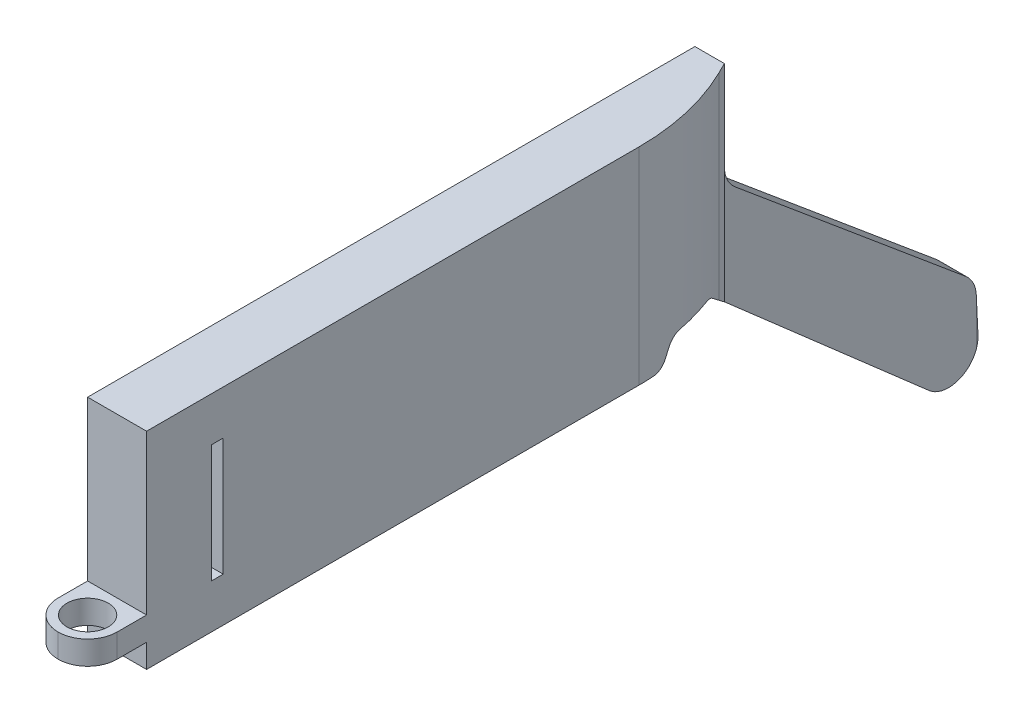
ISO-10303-21;
HEADER;
FILE_DESCRIPTION(('STEP AP214'),'2;1');
FILE_NAME('part.step','',(''),(''),'','','');
FILE_SCHEMA(('AUTOMOTIVE_DESIGN { 1 0 10303 214 1 1 1 1 }'));
ENDSEC;
DATA;
#1=APPLICATION_CONTEXT('core data for automotive mechanical design processes');
#2=APPLICATION_PROTOCOL_DEFINITION('international standard','automotive_design',2000,#1);
#3=PRODUCT_CONTEXT('',#1,'mechanical');
#4=PRODUCT('Part','Part','',(#3));
#5=PRODUCT_RELATED_PRODUCT_CATEGORY('part','',(#4));
#6=PRODUCT_DEFINITION_FORMATION('','',#4);
#7=PRODUCT_DEFINITION_CONTEXT('part definition',#1,'design');
#8=PRODUCT_DEFINITION('design','',#6,#7);
#9=PRODUCT_DEFINITION_SHAPE('','',#8);
#10=(LENGTH_UNIT() NAMED_UNIT(*) SI_UNIT(.MILLI.,.METRE.));
#11=(NAMED_UNIT(*) PLANE_ANGLE_UNIT() SI_UNIT($,.RADIAN.));
#12=(NAMED_UNIT(*) SI_UNIT($,.STERADIAN.) SOLID_ANGLE_UNIT());
#13=UNCERTAINTY_MEASURE_WITH_UNIT(LENGTH_MEASURE(1.E-05),#10,'distance_accuracy_value','');
#14=(GEOMETRIC_REPRESENTATION_CONTEXT(3) GLOBAL_UNCERTAINTY_ASSIGNED_CONTEXT((#13)) GLOBAL_UNIT_ASSIGNED_CONTEXT((#10,
#11,#12)) REPRESENTATION_CONTEXT('',''));
#15=CARTESIAN_POINT('',(0.,0.,0.));
#16=DIRECTION('',(0.,0.,1.));
#17=DIRECTION('',(1.,0.,0.));
#18=AXIS2_PLACEMENT_3D('',#15,#16,#17);
#19=CARTESIAN_POINT('',(27.,0.,0.));
#20=DIRECTION('',(-1.,0.,0.));
#21=DIRECTION('',(0.,0.,-1.));
#22=AXIS2_PLACEMENT_3D('',#19,#20,#21);
#23=PLANE('',#22);
#24=DIRECTION('',(0.,-1.,0.));
#25=VECTOR('',#24,1.);
#26=CARTESIAN_POINT('',(27.,0.,-21.));
#27=LINE('',#26,#25);
#28=CARTESIAN_POINT('',(27.,3.5,-21.));
#29=VERTEX_POINT('',#28);
#30=CARTESIAN_POINT('',(27.,-16.5,-21.));
#31=VERTEX_POINT('',#30);
#32=EDGE_CURVE('E444',#29,#31,#27,.T.);
#33=ORIENTED_EDGE('',*,*,#32,.T.);
#34=DIRECTION('',(0.,0.,-1.));
#35=VECTOR('',#34,1.);
#36=CARTESIAN_POINT('',(27.,-16.5,0.));
#37=LINE('',#36,#35);
#38=CARTESIAN_POINT('',(27.,-16.5,-23.));
#39=VERTEX_POINT('',#38);
#40=EDGE_CURVE('E440',#31,#39,#37,.T.);
#41=ORIENTED_EDGE('',*,*,#40,.T.);
#42=DIRECTION('',(0.,1.,0.));
#43=VECTOR('',#42,1.);
#44=CARTESIAN_POINT('',(27.,0.,-23.));
#45=LINE('',#44,#43);
#46=CARTESIAN_POINT('',(27.,3.5,-23.));
#47=VERTEX_POINT('',#46);
#48=EDGE_CURVE('E437',#39,#47,#45,.T.);
#49=ORIENTED_EDGE('',*,*,#48,.T.);
#50=DIRECTION('',(0.,0.,1.));
#51=VECTOR('',#50,1.);
#52=CARTESIAN_POINT('',(27.,3.5,0.));
#53=LINE('',#52,#51);
#54=EDGE_CURVE('E404',#47,#29,#53,.T.);
#55=ORIENTED_EDGE('',*,*,#54,.T.);
#56=EDGE_LOOP('',(#33,#41,#49,#55));
#57=FACE_BOUND('',#56,.T.);
#58=DIRECTION('',(0.,0.,1.));
#59=VECTOR('',#58,1.);
#60=CARTESIAN_POINT('',(27.,-11.2,0.));
#61=LINE('',#60,#59);
#62=CARTESIAN_POINT('',(27.,-11.2,-107.743987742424));
#63=VERTEX_POINT('',#62);
#64=CARTESIAN_POINT('',(27.,-11.2,-97.5));
#65=VERTEX_POINT('',#64);
#66=EDGE_CURVE('E532',#63,#65,#61,.T.);
#67=ORIENTED_EDGE('',*,*,#66,.T.);
#68=DIRECTION('',(0.,-1.,0.));
#69=VECTOR('',#68,1.);
#70=CARTESIAN_POINT('',(27.,0.,-97.5));
#71=LINE('',#70,#69);
#72=CARTESIAN_POINT('',(27.,-21.5,-97.5));
#73=VERTEX_POINT('',#72);
#74=EDGE_CURVE('E512',#65,#73,#71,.T.);
#75=ORIENTED_EDGE('',*,*,#74,.T.);
#76=DIRECTION('',(0.,0.,-1.));
#77=VECTOR('',#76,1.);
#78=CARTESIAN_POINT('',(27.,-21.5,-15.));
#79=LINE('',#78,#77);
#80=CARTESIAN_POINT('',(27.,-21.5,-90.5));
#81=VERTEX_POINT('',#80);
#82=EDGE_CURVE('E788',#81,#73,#79,.T.);
#83=ORIENTED_EDGE('',*,*,#82,.F.);
#84=DIRECTION('',(0.,-1.,0.));
#85=VECTOR('',#84,1.);
#86=CARTESIAN_POINT('',(27.,-21.5,-90.5));
#87=LINE('',#86,#85);
#88=CARTESIAN_POINT('',(27.,-24.,-90.5));
#89=VERTEX_POINT('',#88);
#90=EDGE_CURVE('E549',#81,#89,#87,.T.);
#91=ORIENTED_EDGE('',*,*,#90,.T.);
#92=DIRECTION('',(0.,0.,1.));
#93=VECTOR('',#92,1.);
#94=CARTESIAN_POINT('',(27.,-24.,-97.5));
#95=LINE('',#94,#93);
#96=CARTESIAN_POINT('',(27.,-24.,-77.5));
#97=VERTEX_POINT('',#96);
#98=EDGE_CURVE('E637',#89,#97,#95,.T.);
#99=ORIENTED_EDGE('',*,*,#98,.T.);
#100=DIRECTION('',(0.,1.,0.));
#101=VECTOR('',#100,1.);
#102=CARTESIAN_POINT('',(27.,-24.,-77.5));
#103=LINE('',#102,#101);
#104=CARTESIAN_POINT('',(27.,-21.5,-77.5));
#105=VERTEX_POINT('',#104);
#106=EDGE_CURVE('E645',#97,#105,#103,.T.);
#107=ORIENTED_EDGE('',*,*,#106,.T.);
#108=CARTESIAN_POINT('',(27.,-21.5,-67.5));
#109=VERTEX_POINT('',#108);
#110=EDGE_CURVE('E795',#109,#105,#79,.T.);
#111=ORIENTED_EDGE('',*,*,#110,.F.);
#112=DIRECTION('',(0.,1.,0.));
#113=VECTOR('',#112,1.);
#114=CARTESIAN_POINT('',(27.,-24.,-67.5));
#115=LINE('',#114,#113);
#116=CARTESIAN_POINT('',(27.,-24.,-67.5));
#117=VERTEX_POINT('',#116);
#118=EDGE_CURVE('E636',#117,#109,#115,.T.);
#119=ORIENTED_EDGE('',*,*,#118,.F.);
#120=DIRECTION('',(0.,0.,1.));
#121=VECTOR('',#120,1.);
#122=CARTESIAN_POINT('',(27.,-24.,-67.5));
#123=LINE('',#122,#121);
#124=CARTESIAN_POINT('',(27.,-24.,-37.5));
#125=VERTEX_POINT('',#124);
#126=EDGE_CURVE('E675',#117,#125,#123,.T.);
#127=ORIENTED_EDGE('',*,*,#126,.T.);
#128=DIRECTION('',(0.,1.,0.));
#129=VECTOR('',#128,1.);
#130=CARTESIAN_POINT('',(27.,-24.,-37.5));
#131=LINE('',#130,#129);
#132=CARTESIAN_POINT('',(27.,-21.5,-37.5));
#133=VERTEX_POINT('',#132);
#134=EDGE_CURVE('E657',#125,#133,#131,.T.);
#135=ORIENTED_EDGE('',*,*,#134,.T.);
#136=CARTESIAN_POINT('',(27.,-21.5,-15.));
#137=VERTEX_POINT('',#136);
#138=EDGE_CURVE('E790',#137,#133,#79,.T.);
#139=ORIENTED_EDGE('',*,*,#138,.F.);
#140=DIRECTION('',(0.,-1.,0.));
#141=VECTOR('',#140,1.);
#142=CARTESIAN_POINT('',(27.,8.5,-15.));
#143=LINE('',#142,#141);
#144=CARTESIAN_POINT('',(27.,8.8,-15.));
#145=VERTEX_POINT('',#144);
#146=EDGE_CURVE('E784',#145,#137,#143,.T.);
#147=ORIENTED_EDGE('',*,*,#146,.F.);
#148=DIRECTION('',(0.,0.,1.));
#149=VECTOR('',#148,1.);
#150=CARTESIAN_POINT('',(27.,8.8,-15.));
#151=LINE('',#150,#149);
#152=CARTESIAN_POINT('',(27.,8.8,-107.743987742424));
#153=VERTEX_POINT('',#152);
#154=EDGE_CURVE('E571',#153,#145,#151,.T.);
#155=ORIENTED_EDGE('',*,*,#154,.F.);
#156=DIRECTION('',(0.,1.,0.));
#157=VECTOR('',#156,1.);
#158=CARTESIAN_POINT('',(27.,-17.2,-107.743987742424));
#159=LINE('',#158,#157);
#160=EDGE_CURVE('E451',#63,#153,#159,.T.);
#161=ORIENTED_EDGE('',*,*,#160,.F.);
#162=EDGE_LOOP('',(#67,#75,#83,#91,#99,#107,#111,#119,#127,#135,#139,#147,#155,#161));
#163=FACE_BOUND('',#162,.T.);
#164=ADVANCED_FACE('F44',(#57,#163),#23,.T.);
#165=CARTESIAN_POINT('',(27.,8.5,-110.));
#166=DIRECTION('',(0.,0.,-1.));
#167=DIRECTION('',(1.,0.,0.));
#168=AXIS2_PLACEMENT_3D('',#165,#166,#167);
#169=PLANE('',#168);
#170=DIRECTION('',(0.,1.,0.));
#171=VECTOR('',#170,1.);
#172=CARTESIAN_POINT('',(25.5587524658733,-17.2,-110.));
#173=LINE('',#172,#171);
#174=CARTESIAN_POINT('',(25.5587524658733,-11.2,-110.));
#175=VERTEX_POINT('',#174);
#176=CARTESIAN_POINT('',(25.5587524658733,8.8,-110.));
#177=VERTEX_POINT('',#176);
#178=EDGE_CURVE('E455',#175,#177,#173,.T.);
#179=ORIENTED_EDGE('',*,*,#178,.T.);
#180=DIRECTION('',(-1.,0.,0.));
#181=VECTOR('',#180,1.);
#182=CARTESIAN_POINT('',(27.,8.8,-110.));
#183=LINE('',#182,#181);
#184=CARTESIAN_POINT('',(23.,8.8,-110.));
#185=VERTEX_POINT('',#184);
#186=EDGE_CURVE('E585',#177,#185,#183,.T.);
#187=ORIENTED_EDGE('',*,*,#186,.T.);
#188=DIRECTION('',(0.,1.,0.));
#189=VECTOR('',#188,1.);
#190=CARTESIAN_POINT('',(23.,8.5,-110.));
#191=LINE('',#190,#189);
#192=CARTESIAN_POINT('',(23.,-11.2,-110.));
#193=VERTEX_POINT('',#192);
#194=EDGE_CURVE('E589',#193,#185,#191,.T.);
#195=ORIENTED_EDGE('',*,*,#194,.F.);
#196=DIRECTION('',(-1.,0.,0.));
#197=VECTOR('',#196,1.);
#198=CARTESIAN_POINT('',(30.,-11.2,-110.));
#199=LINE('',#198,#197);
#200=EDGE_CURVE('E513',#175,#193,#199,.T.);
#201=ORIENTED_EDGE('',*,*,#200,.F.);
#202=EDGE_LOOP('',(#179,#187,#195,#201));
#203=FACE_BOUND('',#202,.T.);
#204=ADVANCED_FACE('F1027',(#203),#169,.F.);
#205=CARTESIAN_POINT('',(27.,8.8,-15.));
#206=DIRECTION('',(0.,1.,0.));
#207=DIRECTION('',(0.,0.,1.));
#208=AXIS2_PLACEMENT_3D('',#205,#206,#207);
#209=PLANE('',#208);
#210=DIRECTION('',(0.538364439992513,0.,0.842712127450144));
#211=VECTOR('',#210,1.);
#212=CARTESIAN_POINT('',(27.,8.8,-107.743987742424));
#213=LINE('',#212,#211);
#214=EDGE_CURVE('E448',#177,#153,#213,.T.);
#215=ORIENTED_EDGE('',*,*,#214,.T.);
#216=ORIENTED_EDGE('',*,*,#154,.T.);
#217=DIRECTION('',(-1.,0.,0.));
#218=VECTOR('',#217,1.);
#219=CARTESIAN_POINT('',(27.,8.8,-15.));
#220=LINE('',#219,#218);
#221=CARTESIAN_POINT('',(20.,8.8,-15.));
#222=VERTEX_POINT('',#221);
#223=EDGE_CURVE('E580',#145,#222,#220,.T.);
#224=ORIENTED_EDGE('',*,*,#223,.T.);
#225=DIRECTION('',(0.,0.,1.));
#226=VECTOR('',#225,1.);
#227=CARTESIAN_POINT('',(20.,8.8,-15.));
#228=LINE('',#227,#226);
#229=CARTESIAN_POINT('',(20.,8.8,-110.));
#230=VERTEX_POINT('',#229);
#231=EDGE_CURVE('E576',#230,#222,#228,.T.);
#232=ORIENTED_EDGE('',*,*,#231,.F.);
#233=CARTESIAN_POINT('',(22.,8.8,-110.));
#234=VERTEX_POINT('',#233);
#235=EDGE_CURVE('E575',#234,#230,#183,.T.);
#236=ORIENTED_EDGE('',*,*,#235,.F.);
#237=DIRECTION('',(0.,0.,-1.));
#238=VECTOR('',#237,1.);
#239=CARTESIAN_POINT('',(22.,8.8,-15.));
#240=LINE('',#239,#238);
#241=CARTESIAN_POINT('',(22.,8.8,-107.5));
#242=VERTEX_POINT('',#241);
#243=EDGE_CURVE('E903',#242,#234,#240,.T.);
#244=ORIENTED_EDGE('',*,*,#243,.F.);
#245=DIRECTION('',(-1.,0.,0.));
#246=VECTOR('',#245,1.);
#247=CARTESIAN_POINT('',(27.,8.8,-107.5));
#248=LINE('',#247,#246);
#249=CARTESIAN_POINT('',(23.,8.8,-107.5));
#250=VERTEX_POINT('',#249);
#251=EDGE_CURVE('E1182',#250,#242,#248,.T.);
#252=ORIENTED_EDGE('',*,*,#251,.F.);
#253=DIRECTION('',(0.,0.,1.));
#254=VECTOR('',#253,1.);
#255=CARTESIAN_POINT('',(23.,8.8,-15.));
#256=LINE('',#255,#254);
#257=EDGE_CURVE('E1178',#185,#250,#256,.T.);
#258=ORIENTED_EDGE('',*,*,#257,.F.);
#259=ORIENTED_EDGE('',*,*,#186,.F.);
#260=EDGE_LOOP('',(#215,#216,#224,#232,#236,#244,#252,#258,#259));
#261=FACE_BOUND('',#260,.T.);
#262=ADVANCED_FACE('F1033',(#261),#209,.F.);
#263=CARTESIAN_POINT('',(30.,-11.2,-97.5));
#264=DIRECTION('',(0.,1.,0.));
#265=DIRECTION('',(0.,0.,1.));
#266=AXIS2_PLACEMENT_3D('',#263,#264,#265);
#267=PLANE('',#266);
#268=ORIENTED_EDGE('',*,*,#200,.T.);
#269=DIRECTION('',(0.,0.,1.));
#270=VECTOR('',#269,1.);
#271=CARTESIAN_POINT('',(23.,-11.2,-110.));
#272=LINE('',#271,#270);
#273=CARTESIAN_POINT('',(23.,-11.2,-107.5));
#274=VERTEX_POINT('',#273);
#275=EDGE_CURVE('E520',#193,#274,#272,.T.);
#276=ORIENTED_EDGE('',*,*,#275,.T.);
#277=DIRECTION('',(1.,0.,0.));
#278=VECTOR('',#277,1.);
#279=CARTESIAN_POINT('',(20.,-11.2,-107.5));
#280=LINE('',#279,#278);
#281=CARTESIAN_POINT('',(22.,-11.2,-107.5));
#282=VERTEX_POINT('',#281);
#283=EDGE_CURVE('E524',#282,#274,#280,.T.);
#284=ORIENTED_EDGE('',*,*,#283,.F.);
#285=DIRECTION('',(0.,0.,-1.));
#286=VECTOR('',#285,1.);
#287=CARTESIAN_POINT('',(22.,-11.2,-107.5));
#288=LINE('',#287,#286);
#289=CARTESIAN_POINT('',(22.,-11.2,-110.));
#290=VERTEX_POINT('',#289);
#291=EDGE_CURVE('E528',#282,#290,#288,.T.);
#292=ORIENTED_EDGE('',*,*,#291,.T.);
#293=CARTESIAN_POINT('',(20.,-11.2,-110.));
#294=VERTEX_POINT('',#293);
#295=EDGE_CURVE('E507',#290,#294,#199,.T.);
#296=ORIENTED_EDGE('',*,*,#295,.T.);
#297=DIRECTION('',(0.,0.,1.));
#298=VECTOR('',#297,1.);
#299=CARTESIAN_POINT('',(20.,-11.2,-97.5));
#300=LINE('',#299,#298);
#301=CARTESIAN_POINT('',(20.,-11.2,-97.5));
#302=VERTEX_POINT('',#301);
#303=EDGE_CURVE('E500',#294,#302,#300,.T.);
#304=ORIENTED_EDGE('',*,*,#303,.T.);
#305=DIRECTION('',(-1.,0.,0.));
#306=VECTOR('',#305,1.);
#307=CARTESIAN_POINT('',(30.,-11.2,-97.5));
#308=LINE('',#307,#306);
#309=EDGE_CURVE('E508',#65,#302,#308,.T.);
#310=ORIENTED_EDGE('',*,*,#309,.F.);
#311=ORIENTED_EDGE('',*,*,#66,.F.);
#312=DIRECTION('',(0.538364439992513,0.,0.842712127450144));
#313=VECTOR('',#312,1.);
#314=CARTESIAN_POINT('',(32.5170651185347,-11.2,-99.1080204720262));
#315=LINE('',#314,#313);
#316=EDGE_CURVE('E951',#175,#63,#315,.T.);
#317=ORIENTED_EDGE('',*,*,#316,.F.);
#318=EDGE_LOOP('',(#268,#276,#284,#292,#296,#304,#310,#311,#317));
#319=FACE_BOUND('',#318,.T.);
#320=ADVANCED_FACE('F1124',(#319),#267,.T.);
#321=CARTESIAN_POINT('',(27.,-21.5,-15.));
#322=DIRECTION('',(0.,-1.,0.));
#323=DIRECTION('',(0.,0.,-1.));
#324=AXIS2_PLACEMENT_3D('',#321,#322,#323);
#325=PLANE('',#324);
#326=DIRECTION('',(1.,0.,0.));
#327=VECTOR('',#326,1.);
#328=CARTESIAN_POINT('',(20.,-21.5,-97.5));
#329=LINE('',#328,#327);
#330=CARTESIAN_POINT('',(20.,-21.5,-97.5));
#331=VERTEX_POINT('',#330);
#332=EDGE_CURVE('E540',#331,#73,#329,.T.);
#333=ORIENTED_EDGE('',*,*,#332,.F.);
#334=DIRECTION('',(0.,0.,-1.));
#335=VECTOR('',#334,1.);
#336=CARTESIAN_POINT('',(20.,-21.5,-15.));
#337=LINE('',#336,#335);
#338=CARTESIAN_POINT('',(20.,-21.5,-90.5));
#339=VERTEX_POINT('',#338);
#340=EDGE_CURVE('E799',#339,#331,#337,.T.);
#341=ORIENTED_EDGE('',*,*,#340,.F.);
#342=DIRECTION('',(1.,0.,0.));
#343=VECTOR('',#342,1.);
#344=CARTESIAN_POINT('',(20.,-21.5,-90.5));
#345=LINE('',#344,#343);
#346=EDGE_CURVE('E546',#339,#81,#345,.T.);
#347=ORIENTED_EDGE('',*,*,#346,.T.);
#348=ORIENTED_EDGE('',*,*,#82,.T.);
#349=EDGE_LOOP('',(#333,#341,#347,#348));
#350=FACE_BOUND('',#349,.T.);
#351=ADVANCED_FACE('F1047',(#350),#325,.F.);
#352=CARTESIAN_POINT('',(22.,8.5,-107.5));
#353=DIRECTION('',(1.,0.,0.));
#354=DIRECTION('',(0.,-1.,0.));
#355=AXIS2_PLACEMENT_3D('',#352,#353,#354);
#356=PLANE('',#355);
#357=DIRECTION('',(0.,1.,0.));
#358=VECTOR('',#357,1.);
#359=CARTESIAN_POINT('',(22.,8.5,-107.5));
#360=LINE('',#359,#358);
#361=EDGE_CURVE('E686',#282,#242,#360,.T.);
#362=ORIENTED_EDGE('',*,*,#361,.T.);
#363=ORIENTED_EDGE('',*,*,#243,.T.);
#364=DIRECTION('',(0.,1.,0.));
#365=VECTOR('',#364,1.);
#366=CARTESIAN_POINT('',(22.,8.5,-110.));
#367=LINE('',#366,#365);
#368=EDGE_CURVE('E653',#290,#234,#367,.T.);
#369=ORIENTED_EDGE('',*,*,#368,.F.);
#370=ORIENTED_EDGE('',*,*,#291,.F.);
#371=EDGE_LOOP('',(#362,#363,#369,#370));
#372=FACE_BOUND('',#371,.T.);
#373=ADVANCED_FACE('F1190',(#372),#356,.F.);
#374=CARTESIAN_POINT('',(20.,0.,-107.5));
#375=DIRECTION('',(0.,0.,1.));
#376=DIRECTION('',(-1.,0.,0.));
#377=AXIS2_PLACEMENT_3D('',#374,#375,#376);
#378=PLANE('',#377);
#379=ORIENTED_EDGE('',*,*,#283,.T.);
#380=DIRECTION('',(0.,1.,0.));
#381=VECTOR('',#380,1.);
#382=CARTESIAN_POINT('',(23.,8.5,-107.5));
#383=LINE('',#382,#381);
#384=EDGE_CURVE('E584',#274,#250,#383,.T.);
#385=ORIENTED_EDGE('',*,*,#384,.T.);
#386=ORIENTED_EDGE('',*,*,#251,.T.);
#387=ORIENTED_EDGE('',*,*,#361,.F.);
#388=EDGE_LOOP('',(#379,#385,#386,#387));
#389=FACE_BOUND('',#388,.T.);
#390=ADVANCED_FACE('F1214',(#389),#378,.T.);
#391=CARTESIAN_POINT('',(23.,8.5,-110.));
#392=DIRECTION('',(-1.,0.,0.));
#393=DIRECTION('',(0.,1.,0.));
#394=AXIS2_PLACEMENT_3D('',#391,#392,#393);
#395=PLANE('',#394);
#396=ORIENTED_EDGE('',*,*,#194,.T.);
#397=ORIENTED_EDGE('',*,*,#257,.T.);
#398=ORIENTED_EDGE('',*,*,#384,.F.);
#399=ORIENTED_EDGE('',*,*,#275,.F.);
#400=EDGE_LOOP('',(#396,#397,#398,#399));
#401=FACE_BOUND('',#400,.T.);
#402=ADVANCED_FACE('F1194',(#401),#395,.F.);
#403=ORIENTED_EDGE('',*,*,#368,.T.);
#404=ORIENTED_EDGE('',*,*,#235,.T.);
#405=DIRECTION('',(0.,1.,0.));
#406=VECTOR('',#405,1.);
#407=CARTESIAN_POINT('',(20.,8.5,-110.));
#408=LINE('',#407,#406);
#409=EDGE_CURVE('E689',#294,#230,#408,.T.);
#410=ORIENTED_EDGE('',*,*,#409,.F.);
#411=ORIENTED_EDGE('',*,*,#295,.F.);
#412=EDGE_LOOP('',(#403,#404,#410,#411));
#413=FACE_BOUND('',#412,.T.);
#414=ADVANCED_FACE('F1036',(#413),#169,.F.);
#415=CARTESIAN_POINT('',(30.,11.,-10.));
#416=DIRECTION('',(0.,0.,1.));
#417=DIRECTION('',(0.,-1.,0.));
#418=AXIS2_PLACEMENT_3D('',#415,#416,#417);
#419=PLANE('',#418);
#420=DIRECTION('',(0.,-1.,0.));
#421=VECTOR('',#420,1.);
#422=CARTESIAN_POINT('',(20.,11.,-10.));
#423=LINE('',#422,#421);
#424=CARTESIAN_POINT('',(20.,-20.,-10.));
#425=VERTEX_POINT('',#424);
#426=CARTESIAN_POINT('',(20.,-24.,-10.));
#427=VERTEX_POINT('',#426);
#428=EDGE_CURVE('E806',#425,#427,#423,.T.);
#429=ORIENTED_EDGE('',*,*,#428,.T.);
#430=DIRECTION('',(-1.,0.,0.));
#431=VECTOR('',#430,1.);
#432=CARTESIAN_POINT('',(30.,-24.,-10.));
#433=LINE('',#432,#431);
#434=CARTESIAN_POINT('',(30.,-24.,-10.));
#435=VERTEX_POINT('',#434);
#436=EDGE_CURVE('E820',#435,#427,#433,.T.);
#437=ORIENTED_EDGE('',*,*,#436,.F.);
#438=DIRECTION('',(0.,-1.,0.));
#439=VECTOR('',#438,1.);
#440=CARTESIAN_POINT('',(30.,11.,-10.));
#441=LINE('',#440,#439);
#442=CARTESIAN_POINT('',(30.,-20.,-10.));
#443=VERTEX_POINT('',#442);
#444=EDGE_CURVE('E812',#443,#435,#441,.T.);
#445=ORIENTED_EDGE('',*,*,#444,.F.);
#446=DIRECTION('',(1.,0.,0.));
#447=VECTOR('',#446,1.);
#448=CARTESIAN_POINT('',(20.,-20.,-10.));
#449=LINE('',#448,#447);
#450=EDGE_CURVE('E610',#425,#443,#449,.T.);
#451=ORIENTED_EDGE('',*,*,#450,.F.);
#452=EDGE_LOOP('',(#429,#437,#445,#451));
#453=FACE_BOUND('',#452,.T.);
#454=ADVANCED_FACE('F1065',(#453),#419,.T.);
#455=CARTESIAN_POINT('',(20.,-21.5,-67.5));
#456=VERTEX_POINT('',#455);
#457=CARTESIAN_POINT('',(20.,-21.5,-77.5));
#458=VERTEX_POINT('',#457);
#459=EDGE_CURVE('E803',#456,#458,#337,.T.);
#460=ORIENTED_EDGE('',*,*,#459,.F.);
#461=DIRECTION('',(1.,0.,0.));
#462=VECTOR('',#461,1.);
#463=CARTESIAN_POINT('',(27.,-21.5,-67.5));
#464=LINE('',#463,#462);
#465=EDGE_CURVE('E672',#456,#109,#464,.T.);
#466=ORIENTED_EDGE('',*,*,#465,.T.);
#467=ORIENTED_EDGE('',*,*,#110,.T.);
#468=DIRECTION('',(-1.,0.,0.));
#469=VECTOR('',#468,1.);
#470=CARTESIAN_POINT('',(27.,-21.5,-77.5));
#471=LINE('',#470,#469);
#472=EDGE_CURVE('E642',#105,#458,#471,.T.);
#473=ORIENTED_EDGE('',*,*,#472,.T.);
#474=EDGE_LOOP('',(#460,#466,#467,#473));
#475=FACE_BOUND('',#474,.T.);
#476=ADVANCED_FACE('F1048',(#475),#325,.F.);
#477=CARTESIAN_POINT('',(20.,4.,0.));
#478=DIRECTION('',(1.,0.,0.));
#479=DIRECTION('',(0.,0.,1.));
#480=AXIS2_PLACEMENT_3D('',#477,#478,#479);
#481=PLANE('',#480);
#482=DIRECTION('',(0.,0.,-1.));
#483=VECTOR('',#482,1.);
#484=CARTESIAN_POINT('',(20.,-24.,-90.5));
#485=LINE('',#484,#483);
#486=CARTESIAN_POINT('',(20.,-24.,-90.5));
#487=VERTEX_POINT('',#486);
#488=CARTESIAN_POINT('',(20.,-24.,-96.028454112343));
#489=VERTEX_POINT('',#488);
#490=EDGE_CURVE('E556',#487,#489,#485,.T.);
#491=ORIENTED_EDGE('',*,*,#490,.F.);
#492=DIRECTION('',(0.,1.,0.));
#493=VECTOR('',#492,1.);
#494=CARTESIAN_POINT('',(20.,-21.5,-90.5));
#495=LINE('',#494,#493);
#496=EDGE_CURVE('E543',#487,#339,#495,.T.);
#497=ORIENTED_EDGE('',*,*,#496,.T.);
#498=ORIENTED_EDGE('',*,*,#340,.T.);
#499=DIRECTION('',(0.,-1.,0.));
#500=VECTOR('',#499,1.);
#501=CARTESIAN_POINT('',(20.,-21.5,-97.5));
#502=LINE('',#501,#500);
#503=EDGE_CURVE('E504',#302,#331,#502,.T.);
#504=ORIENTED_EDGE('',*,*,#503,.F.);
#505=ORIENTED_EDGE('',*,*,#303,.F.);
#506=ORIENTED_EDGE('',*,*,#409,.T.);
#507=ORIENTED_EDGE('',*,*,#231,.T.);
#508=DIRECTION('',(0.,-1.,0.));
#509=VECTOR('',#508,1.);
#510=CARTESIAN_POINT('',(20.,8.5,-15.));
#511=LINE('',#510,#509);
#512=CARTESIAN_POINT('',(20.,-21.5,-15.));
#513=VERTEX_POINT('',#512);
#514=EDGE_CURVE('E736',#222,#513,#511,.T.);
#515=ORIENTED_EDGE('',*,*,#514,.T.);
#516=CARTESIAN_POINT('',(20.,-21.5,-37.5));
#517=VERTEX_POINT('',#516);
#518=EDGE_CURVE('E789',#513,#517,#337,.T.);
#519=ORIENTED_EDGE('',*,*,#518,.T.);
#520=DIRECTION('',(0.,1.,0.));
#521=VECTOR('',#520,1.);
#522=CARTESIAN_POINT('',(20.,-24.,-37.5));
#523=LINE('',#522,#521);
#524=CARTESIAN_POINT('',(20.,-24.,-37.5));
#525=VERTEX_POINT('',#524);
#526=EDGE_CURVE('E662',#525,#517,#523,.T.);
#527=ORIENTED_EDGE('',*,*,#526,.F.);
#528=DIRECTION('',(0.,0.,-1.));
#529=VECTOR('',#528,1.);
#530=CARTESIAN_POINT('',(20.,-24.,-10.));
#531=LINE('',#530,#529);
#532=EDGE_CURVE('E826',#427,#525,#531,.T.);
#533=ORIENTED_EDGE('',*,*,#532,.F.);
#534=ORIENTED_EDGE('',*,*,#428,.F.);
#535=DIRECTION('',(0.,0.,1.));
#536=VECTOR('',#535,1.);
#537=CARTESIAN_POINT('',(20.,-20.,-10.));
#538=LINE('',#537,#536);
#539=CARTESIAN_POINT('',(20.,-20.,-5.));
#540=VERTEX_POINT('',#539);
#541=EDGE_CURVE('E601',#425,#540,#538,.T.);
#542=ORIENTED_EDGE('',*,*,#541,.T.);
#543=DIRECTION('',(0.,1.,0.));
#544=VECTOR('',#543,1.);
#545=CARTESIAN_POINT('',(20.,-20.,-5.));
#546=LINE('',#545,#544);
#547=CARTESIAN_POINT('',(20.,-16.,-5.));
#548=VERTEX_POINT('',#547);
#549=EDGE_CURVE('E872',#548,#540,#546,.F.);
#550=ORIENTED_EDGE('',*,*,#549,.F.);
#551=DIRECTION('',(0.,0.,-1.));
#552=VECTOR('',#551,1.);
#553=CARTESIAN_POINT('',(20.,-16.,-10.));
#554=LINE('',#553,#552);
#555=CARTESIAN_POINT('',(20.,-16.,-10.));
#556=VERTEX_POINT('',#555);
#557=EDGE_CURVE('E605',#548,#556,#554,.T.);
#558=ORIENTED_EDGE('',*,*,#557,.T.);
#559=CARTESIAN_POINT('',(20.,11.,-10.));
#560=VERTEX_POINT('',#559);
#561=EDGE_CURVE('E821',#560,#556,#423,.T.);
#562=ORIENTED_EDGE('',*,*,#561,.F.);
#563=DIRECTION('',(0.,0.,1.));
#564=VECTOR('',#563,1.);
#565=CARTESIAN_POINT('',(20.,11.,-10.));
#566=LINE('',#565,#564);
#567=CARTESIAN_POINT('',(20.,11.,-113.));
#568=VERTEX_POINT('',#567);
#569=EDGE_CURVE('E830',#568,#560,#566,.T.);
#570=ORIENTED_EDGE('',*,*,#569,.F.);
#571=DIRECTION('',(0.,-1.,0.));
#572=VECTOR('',#571,1.);
#573=CARTESIAN_POINT('',(20.,11.,-113.));
#574=LINE('',#573,#572);
#575=CARTESIAN_POINT('',(20.,-4.16321713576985,-113.));
#576=VERTEX_POINT('',#575);
#577=EDGE_CURVE('E694',#568,#576,#574,.T.);
#578=ORIENTED_EDGE('',*,*,#577,.T.);
#579=CARTESIAN_POINT('',(20.,-4.16321713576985,-118.));
#580=DIRECTION('',(-1.,0.,0.));
#581=DIRECTION('',(0.,0.,1.));
#582=AXIS2_PLACEMENT_3D('',#579,#580,#581);
#583=CIRCLE('',#582,5.);
#584=CARTESIAN_POINT('',(20.,-7.99896951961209,-114.792664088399));
#585=VERTEX_POINT('',#584);
#586=EDGE_CURVE('E1174',#585,#576,#583,.T.);
#587=ORIENTED_EDGE('',*,*,#586,.F.);
#588=DIRECTION('',(0.,0.641467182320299,0.767150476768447));
#589=VECTOR('',#588,1.);
#590=CARTESIAN_POINT('',(20.,-6.5,-113.));
#591=LINE('',#590,#589);
#592=CARTESIAN_POINT('',(20.,-40.7271648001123,-153.933326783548));
#593=VERTEX_POINT('',#592);
#594=EDGE_CURVE('E632',#593,#585,#591,.T.);
#595=ORIENTED_EDGE('',*,*,#594,.F.);
#596=CARTESIAN_POINT('',(20.,-44.5629171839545,-150.725990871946));
#597=DIRECTION('',(-1.,0.,0.));
#598=DIRECTION('',(0.,0.,1.));
#599=AXIS2_PLACEMENT_3D('',#596,#597,#598);
#600=CIRCLE('',#599,5.);
#601=CARTESIAN_POINT('',(20.,-44.3255849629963,-155.720355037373));
#602=VERTEX_POINT('',#601);
#603=EDGE_CURVE('E846',#602,#593,#600,.F.);
#604=ORIENTED_EDGE('',*,*,#603,.F.);
#605=DIRECTION('',(0.,0.998872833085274,0.047466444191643));
#606=VECTOR('',#605,1.);
#607=CARTESIAN_POINT('',(20.,-42.1343538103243,-155.616227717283));
#608=LINE('',#607,#606);
#609=CARTESIAN_POINT('',(20.,-50.3921176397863,-156.00863671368));
#610=VERTEX_POINT('',#609);
#611=EDGE_CURVE('E628',#610,#602,#608,.T.);
#612=ORIENTED_EDGE('',*,*,#611,.F.);
#613=CARTESIAN_POINT('',(20.,-50.6294498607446,-151.014272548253));
#614=DIRECTION('',(-1.,0.,0.));
#615=DIRECTION('',(0.,0.,1.));
#616=AXIS2_PLACEMENT_3D('',#613,#614,#615);
#617=CIRCLE('',#616,5.);
#618=CARTESIAN_POINT('',(20.,-54.3917531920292,-147.72108660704));
#619=VERTEX_POINT('',#618);
#620=EDGE_CURVE('E850',#619,#610,#617,.F.);
#621=ORIENTED_EDGE('',*,*,#620,.F.);
#622=DIRECTION('',(0.,-0.658637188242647,-0.752460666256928));
#623=VECTOR('',#622,1.);
#624=CARTESIAN_POINT('',(20.,-62.1343538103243,-156.566627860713));
#625=LINE('',#624,#623);
#626=CARTESIAN_POINT('',(20.,-25.2376966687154,-114.414007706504));
#627=VERTEX_POINT('',#626);
#628=EDGE_CURVE('E621',#627,#619,#625,.T.);
#629=ORIENTED_EDGE('',*,*,#628,.F.);
#630=CARTESIAN_POINT('',(20.,-29.,-111.120821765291));
#631=DIRECTION('',(-1.,0.,0.));
#632=DIRECTION('',(0.,0.,1.));
#633=AXIS2_PLACEMENT_3D('',#630,#631,#632);
#634=CIRCLE('',#633,5.);
#635=CARTESIAN_POINT('',(20.,-25.2316381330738,-114.407060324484));
#636=VERTEX_POINT('',#635);
#637=EDGE_CURVE('E893',#636,#627,#634,.T.);
#638=ORIENTED_EDGE('',*,*,#637,.F.);
#639=DIRECTION('',(0.,0.657248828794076,0.753673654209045));
#640=VECTOR('',#639,1.);
#641=CARTESIAN_POINT('',(20.,-25.2376966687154,-114.414007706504));
#642=LINE('',#641,#640);
#643=CARTESIAN_POINT('',(20.,-20.6158158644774,-109.114051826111));
#644=VERTEX_POINT('',#643);
#645=EDGE_CURVE('E560',#636,#644,#642,.T.);
#646=ORIENTED_EDGE('',*,*,#645,.T.);
#647=CARTESIAN_POINT('',(20.,-22.5,-107.470929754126));
#648=DIRECTION('',(-1.,0.,0.));
#649=DIRECTION('',(0.,0.,1.));
#650=AXIS2_PLACEMENT_3D('',#647,#648,#649);
#651=CIRCLE('',#650,2.5);
#652=CARTESIAN_POINT('',(20.,-20.,-107.470929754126));
#653=VERTEX_POINT('',#652);
#654=EDGE_CURVE('E930',#653,#644,#651,.T.);
#655=ORIENTED_EDGE('',*,*,#654,.F.);
#656=DIRECTION('',(0.,0.,-1.));
#657=VECTOR('',#656,1.);
#658=CARTESIAN_POINT('',(20.,-20.,-99.7205506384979));
#659=LINE('',#658,#657);
#660=CARTESIAN_POINT('',(20.,-20.,-101.192096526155));
#661=VERTEX_POINT('',#660);
#662=EDGE_CURVE('E536',#661,#653,#659,.T.);
#663=ORIENTED_EDGE('',*,*,#662,.F.);
#664=CARTESIAN_POINT('',(20.,-22.5,-101.192096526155));
#665=DIRECTION('',(-1.,0.,0.));
#666=DIRECTION('',(0.,0.,1.));
#667=AXIS2_PLACEMENT_3D('',#664,#665,#666);
#668=CIRCLE('',#667,2.5);
#669=CARTESIAN_POINT('',(20.,-21.2865907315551,-99.0063156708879));
#670=VERTEX_POINT('',#669);
#671=EDGE_CURVE('E934',#670,#661,#668,.T.);
#672=ORIENTED_EDGE('',*,*,#671,.F.);
#673=DIRECTION('',(0.,-0.874312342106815,0.485363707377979));
#674=VECTOR('',#673,1.);
#675=CARTESIAN_POINT('',(20.,-20.,-99.7205506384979));
#676=LINE('',#675,#674);
#677=CARTESIAN_POINT('',(20.,-22.7134092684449,-98.21423496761));
#678=VERTEX_POINT('',#677);
#679=EDGE_CURVE('E563',#670,#678,#676,.T.);
#680=ORIENTED_EDGE('',*,*,#679,.T.);
#681=CARTESIAN_POINT('',(20.,-21.5,-96.028454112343));
#682=DIRECTION('',(-1.,0.,0.));
#683=DIRECTION('',(0.,0.,1.));
#684=AXIS2_PLACEMENT_3D('',#681,#682,#683);
#685=CIRCLE('',#684,2.5);
#686=EDGE_CURVE('E926',#489,#678,#685,.F.);
#687=ORIENTED_EDGE('',*,*,#686,.F.);
#688=EDGE_LOOP('',(#491,#497,#498,#504,#505,#506,#507,#515,#519,#527,#533,#534,#542,#550,#558,
#562,#570,#578,#587,#595,#604,#612,#621,#629,#638,#646,#655,#663,#672,#680,#687));
#689=FACE_BOUND('',#688,.T.);
#690=ADVANCED_FACE('F1045',(#689),#481,.F.);
#691=ORIENTED_EDGE('',*,*,#518,.F.);
#692=DIRECTION('',(-1.,0.,0.));
#693=VECTOR('',#692,1.);
#694=CARTESIAN_POINT('',(27.,-21.5,-15.));
#695=LINE('',#694,#693);
#696=EDGE_CURVE('E794',#137,#513,#695,.T.);
#697=ORIENTED_EDGE('',*,*,#696,.F.);
#698=ORIENTED_EDGE('',*,*,#138,.T.);
#699=DIRECTION('',(-1.,0.,0.));
#700=VECTOR('',#699,1.);
#701=CARTESIAN_POINT('',(27.,-21.5,-37.5));
#702=LINE('',#701,#700);
#703=EDGE_CURVE('E649',#133,#517,#702,.T.);
#704=ORIENTED_EDGE('',*,*,#703,.T.);
#705=EDGE_LOOP('',(#691,#697,#698,#704));
#706=FACE_BOUND('',#705,.T.);
#707=ADVANCED_FACE('F1042',(#706),#325,.F.);
#708=CARTESIAN_POINT('',(20.,-24.,-67.5));
#709=VERTEX_POINT('',#708);
#710=CARTESIAN_POINT('',(20.,-24.,-77.5));
#711=VERTEX_POINT('',#710);
#712=EDGE_CURVE('E825',#709,#711,#531,.T.);
#713=ORIENTED_EDGE('',*,*,#712,.F.);
#714=DIRECTION('',(0.,1.,0.));
#715=VECTOR('',#714,1.);
#716=CARTESIAN_POINT('',(20.,-24.,-67.5));
#717=LINE('',#716,#715);
#718=EDGE_CURVE('E666',#709,#456,#717,.T.);
#719=ORIENTED_EDGE('',*,*,#718,.T.);
#720=ORIENTED_EDGE('',*,*,#459,.T.);
#721=DIRECTION('',(0.,1.,0.));
#722=VECTOR('',#721,1.);
#723=CARTESIAN_POINT('',(20.,-24.,-77.5));
#724=LINE('',#723,#722);
#725=EDGE_CURVE('E650',#711,#458,#724,.T.);
#726=ORIENTED_EDGE('',*,*,#725,.F.);
#727=EDGE_LOOP('',(#713,#719,#720,#726));
#728=FACE_BOUND('',#727,.T.);
#729=ADVANCED_FACE('F965',(#728),#481,.F.);
#730=CARTESIAN_POINT('',(30.,4.,0.));
#731=DIRECTION('',(-1.,0.,0.));
#732=DIRECTION('',(0.,0.,-1.));
#733=AXIS2_PLACEMENT_3D('',#730,#731,#732);
#734=PLANE('',#733);
#735=DIRECTION('',(0.,0.,-1.));
#736=VECTOR('',#735,1.);
#737=CARTESIAN_POINT('',(30.,3.5,-21.));
#738=LINE('',#737,#736);
#739=CARTESIAN_POINT('',(30.,3.5,-21.));
#740=VERTEX_POINT('',#739);
#741=CARTESIAN_POINT('',(30.,3.5,-23.));
#742=VERTEX_POINT('',#741);
#743=EDGE_CURVE('E402',#740,#742,#738,.T.);
#744=ORIENTED_EDGE('',*,*,#743,.T.);
#745=DIRECTION('',(0.,-1.,0.));
#746=VECTOR('',#745,1.);
#747=CARTESIAN_POINT('',(30.,3.5,-23.));
#748=LINE('',#747,#746);
#749=CARTESIAN_POINT('',(30.,-16.5,-23.));
#750=VERTEX_POINT('',#749);
#751=EDGE_CURVE('E410',#742,#750,#748,.T.);
#752=ORIENTED_EDGE('',*,*,#751,.T.);
#753=DIRECTION('',(0.,0.,1.));
#754=VECTOR('',#753,1.);
#755=CARTESIAN_POINT('',(30.,-16.5,-21.));
#756=LINE('',#755,#754);
#757=CARTESIAN_POINT('',(30.,-16.5,-21.));
#758=VERTEX_POINT('',#757);
#759=EDGE_CURVE('E416',#750,#758,#756,.T.);
#760=ORIENTED_EDGE('',*,*,#759,.T.);
#761=DIRECTION('',(0.,1.,0.));
#762=VECTOR('',#761,1.);
#763=CARTESIAN_POINT('',(30.,3.5,-21.));
#764=LINE('',#763,#762);
#765=EDGE_CURVE('E420',#758,#740,#764,.T.);
#766=ORIENTED_EDGE('',*,*,#765,.T.);
#767=EDGE_LOOP('',(#744,#752,#760,#766));
#768=FACE_BOUND('',#767,.T.);
#769=DIRECTION('',(0.,0.,1.));
#770=VECTOR('',#769,1.);
#771=CARTESIAN_POINT('',(30.,11.,-10.));
#772=LINE('',#771,#770);
#773=CARTESIAN_POINT('',(30.,11.,-93.5328493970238));
#774=VERTEX_POINT('',#773);
#775=CARTESIAN_POINT('',(30.,11.,-10.));
#776=VERTEX_POINT('',#775);
#777=EDGE_CURVE('E816',#774,#776,#772,.T.);
#778=ORIENTED_EDGE('',*,*,#777,.T.);
#779=CARTESIAN_POINT('',(30.,-16.,-10.));
#780=VERTEX_POINT('',#779);
#781=EDGE_CURVE('E807',#776,#780,#441,.T.);
#782=ORIENTED_EDGE('',*,*,#781,.T.);
#783=DIRECTION('',(0.,0.,-1.));
#784=VECTOR('',#783,1.);
#785=CARTESIAN_POINT('',(30.,-16.,-10.));
#786=LINE('',#785,#784);
#787=CARTESIAN_POINT('',(30.,-16.,-5.));
#788=VERTEX_POINT('',#787);
#789=EDGE_CURVE('E606',#788,#780,#786,.T.);
#790=ORIENTED_EDGE('',*,*,#789,.F.);
#791=DIRECTION('',(0.,1.,0.));
#792=VECTOR('',#791,1.);
#793=CARTESIAN_POINT('',(30.,-16.,-5.));
#794=LINE('',#793,#792);
#795=CARTESIAN_POINT('',(30.,-20.,-5.));
#796=VERTEX_POINT('',#795);
#797=EDGE_CURVE('E883',#796,#788,#794,.T.);
#798=ORIENTED_EDGE('',*,*,#797,.F.);
#799=DIRECTION('',(0.,0.,1.));
#800=VECTOR('',#799,1.);
#801=CARTESIAN_POINT('',(30.,-20.,-10.));
#802=LINE('',#801,#800);
#803=EDGE_CURVE('E611',#443,#796,#802,.T.);
#804=ORIENTED_EDGE('',*,*,#803,.F.);
#805=ORIENTED_EDGE('',*,*,#444,.T.);
#806=DIRECTION('',(0.,0.,-1.));
#807=VECTOR('',#806,1.);
#808=CARTESIAN_POINT('',(30.,-24.,-10.));
#809=LINE('',#808,#807);
#810=CARTESIAN_POINT('',(30.,-24.,-93.5328493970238));
#811=VERTEX_POINT('',#810);
#812=EDGE_CURVE('E811',#435,#811,#809,.T.);
#813=ORIENTED_EDGE('',*,*,#812,.T.);
#814=DIRECTION('',(0.,1.,0.));
#815=VECTOR('',#814,1.);
#816=CARTESIAN_POINT('',(30.,4.,-93.5328493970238));
#817=LINE('',#816,#815);
#818=EDGE_CURVE('E1582',#774,#811,#817,.F.);
#819=ORIENTED_EDGE('',*,*,#818,.F.);
#820=EDGE_LOOP('',(#778,#782,#790,#798,#804,#805,#813,#819));
#821=FACE_BOUND('',#820,.T.);
#822=ADVANCED_FACE('F418',(#768,#821),#734,.F.);
#823=DIRECTION('',(1.,0.,0.));
#824=VECTOR('',#823,1.);
#825=CARTESIAN_POINT('',(20.,-16.,-10.));
#826=LINE('',#825,#824);
#827=EDGE_CURVE('E618',#556,#780,#826,.T.);
#828=ORIENTED_EDGE('',*,*,#827,.T.);
#829=ORIENTED_EDGE('',*,*,#781,.F.);
#830=DIRECTION('',(-1.,0.,0.));
#831=VECTOR('',#830,1.);
#832=CARTESIAN_POINT('',(30.,11.,-10.));
#833=LINE('',#832,#831);
#834=EDGE_CURVE('E834',#776,#560,#833,.T.);
#835=ORIENTED_EDGE('',*,*,#834,.T.);
#836=ORIENTED_EDGE('',*,*,#561,.T.);
#837=EDGE_LOOP('',(#828,#829,#835,#836));
#838=FACE_BOUND('',#837,.T.);
#839=ADVANCED_FACE('F1058',(#838),#419,.T.);
#840=CARTESIAN_POINT('',(30.,11.,-10.));
#841=DIRECTION('',(0.,1.,0.));
#842=DIRECTION('',(0.,0.,1.));
#843=AXIS2_PLACEMENT_3D('',#840,#841,#842);
#844=PLANE('',#843);
#845=DIRECTION('',(-0.441996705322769,0.,-0.897016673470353));
#846=VECTOR('',#845,1.);
#847=CARTESIAN_POINT('',(30.,11.,-102.852676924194));
#848=LINE('',#847,#846);
#849=CARTESIAN_POINT('',(25.8806669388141,11.,-111.212717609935));
#850=VERTEX_POINT('',#849);
#851=CARTESIAN_POINT('',(25.,11.,-113.));
#852=VERTEX_POINT('',#851);
#853=EDGE_CURVE('E459',#850,#852,#848,.T.);
#854=ORIENTED_EDGE('',*,*,#853,.T.);
#855=DIRECTION('',(-1.,0.,0.));
#856=VECTOR('',#855,1.);
#857=CARTESIAN_POINT('',(20.,11.,-113.));
#858=LINE('',#857,#856);
#859=EDGE_CURVE('E698',#852,#568,#858,.T.);
#860=ORIENTED_EDGE('',*,*,#859,.T.);
#861=ORIENTED_EDGE('',*,*,#569,.T.);
#862=ORIENTED_EDGE('',*,*,#834,.F.);
#863=ORIENTED_EDGE('',*,*,#777,.F.);
#864=CARTESIAN_POINT('',(-10.,11.,-93.5328493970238));
#865=DIRECTION('',(0.,-1.,0.));
#866=DIRECTION('',(0.,0.,1.));
#867=AXIS2_PLACEMENT_3D('',#864,#865,#866);
#868=CIRCLE('',#867,40.);
#869=EDGE_CURVE('E1587',#850,#774,#868,.T.);
#870=ORIENTED_EDGE('',*,*,#869,.F.);
#871=EDGE_LOOP('',(#854,#860,#861,#862,#863,#870));
#872=FACE_BOUND('',#871,.T.);
#873=ADVANCED_FACE('F1055',(#872),#844,.T.);
#874=CARTESIAN_POINT('',(30.,-24.,-10.));
#875=DIRECTION('',(0.,-1.,0.));
#876=DIRECTION('',(0.,0.,-1.));
#877=AXIS2_PLACEMENT_3D('',#874,#875,#876);
#878=PLANE('',#877);
#879=ORIENTED_EDGE('',*,*,#812,.F.);
#880=ORIENTED_EDGE('',*,*,#436,.T.);
#881=ORIENTED_EDGE('',*,*,#532,.T.);
#882=DIRECTION('',(-1.,0.,0.));
#883=VECTOR('',#882,1.);
#884=CARTESIAN_POINT('',(27.,-24.,-37.5));
#885=LINE('',#884,#883);
#886=EDGE_CURVE('E680',#125,#525,#885,.T.);
#887=ORIENTED_EDGE('',*,*,#886,.F.);
#888=ORIENTED_EDGE('',*,*,#126,.F.);
#889=DIRECTION('',(1.,0.,0.));
#890=VECTOR('',#889,1.);
#891=CARTESIAN_POINT('',(27.,-24.,-67.5));
#892=LINE('',#891,#890);
#893=EDGE_CURVE('E661',#709,#117,#892,.T.);
#894=ORIENTED_EDGE('',*,*,#893,.F.);
#895=ORIENTED_EDGE('',*,*,#712,.T.);
#896=DIRECTION('',(-1.,0.,0.));
#897=VECTOR('',#896,1.);
#898=CARTESIAN_POINT('',(27.,-24.,-77.5));
#899=LINE('',#898,#897);
#900=EDGE_CURVE('E641',#97,#711,#899,.T.);
#901=ORIENTED_EDGE('',*,*,#900,.F.);
#902=ORIENTED_EDGE('',*,*,#98,.F.);
#903=DIRECTION('',(-1.,0.,0.));
#904=VECTOR('',#903,1.);
#905=CARTESIAN_POINT('',(20.,-24.,-90.5));
#906=LINE('',#905,#904);
#907=EDGE_CURVE('E553',#89,#487,#906,.T.);
#908=ORIENTED_EDGE('',*,*,#907,.T.);
#909=ORIENTED_EDGE('',*,*,#490,.T.);
#910=DIRECTION('',(1.,0.,0.));
#911=VECTOR('',#910,1.);
#912=CARTESIAN_POINT('',(20.,-24.,-96.028454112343));
#913=LINE('',#912,#911);
#914=CARTESIAN_POINT('',(29.9220735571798,-24.,-96.028454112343));
#915=VERTEX_POINT('',#914);
#916=EDGE_CURVE('E923',#915,#489,#913,.F.);
#917=ORIENTED_EDGE('',*,*,#916,.F.);
#918=CARTESIAN_POINT('',(-10.,-24.,-93.5328493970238));
#919=DIRECTION('',(0.,1.,0.));
#920=DIRECTION('',(0.,0.,-1.));
#921=AXIS2_PLACEMENT_3D('',#918,#919,#920);
#922=CIRCLE('',#921,40.);
#923=EDGE_CURVE('E1577',#811,#915,#922,.T.);
#924=ORIENTED_EDGE('',*,*,#923,.F.);
#925=EDGE_LOOP('',(#879,#880,#881,#887,#888,#894,#895,#901,#902,#908,#909,#917,#924));
#926=FACE_BOUND('',#925,.T.);
#927=ADVANCED_FACE('F1053',(#926),#878,.T.);
#928=CARTESIAN_POINT('',(27.,8.5,-15.));
#929=DIRECTION('',(0.,0.,1.));
#930=DIRECTION('',(-1.,0.,0.));
#931=AXIS2_PLACEMENT_3D('',#928,#929,#930);
#932=PLANE('',#931);
#933=DIRECTION('',(1.,0.,0.));
#934=VECTOR('',#933,1.);
#935=CARTESIAN_POINT('',(22.,-19.,-15.));
#936=LINE('',#935,#934);
#937=CARTESIAN_POINT('',(22.,-19.,-15.));
#938=VERTEX_POINT('',#937);
#939=CARTESIAN_POINT('',(24.,-19.,-15.));
#940=VERTEX_POINT('',#939);
#941=EDGE_CURVE('E721',#938,#940,#936,.T.);
#942=ORIENTED_EDGE('',*,*,#941,.T.);
#943=DIRECTION('',(0.,1.,0.));
#944=VECTOR('',#943,1.);
#945=CARTESIAN_POINT('',(24.,-19.,-15.));
#946=LINE('',#945,#944);
#947=CARTESIAN_POINT('',(24.,-14.,-15.));
#948=VERTEX_POINT('',#947);
#949=EDGE_CURVE('E726',#940,#948,#946,.T.);
#950=ORIENTED_EDGE('',*,*,#949,.T.);
#951=DIRECTION('',(-1.,0.,0.));
#952=VECTOR('',#951,1.);
#953=CARTESIAN_POINT('',(22.,-14.,-15.));
#954=LINE('',#953,#952);
#955=CARTESIAN_POINT('',(22.,-14.,-15.));
#956=VERTEX_POINT('',#955);
#957=EDGE_CURVE('E707',#948,#956,#954,.T.);
#958=ORIENTED_EDGE('',*,*,#957,.T.);
#959=DIRECTION('',(0.,-1.,0.));
#960=VECTOR('',#959,1.);
#961=CARTESIAN_POINT('',(22.,-19.,-15.));
#962=LINE('',#961,#960);
#963=EDGE_CURVE('E717',#956,#938,#962,.T.);
#964=ORIENTED_EDGE('',*,*,#963,.T.);
#965=EDGE_LOOP('',(#942,#950,#958,#964));
#966=FACE_BOUND('',#965,.T.);
#967=DIRECTION('',(1.,0.,0.));
#968=VECTOR('',#967,1.);
#969=CARTESIAN_POINT('',(22.,0.999999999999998,-15.));
#970=LINE('',#969,#968);
#971=CARTESIAN_POINT('',(22.,0.999999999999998,-15.));
#972=VERTEX_POINT('',#971);
#973=CARTESIAN_POINT('',(24.,0.999999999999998,-15.));
#974=VERTEX_POINT('',#973);
#975=EDGE_CURVE('E766',#972,#974,#970,.T.);
#976=ORIENTED_EDGE('',*,*,#975,.T.);
#977=DIRECTION('',(0.,1.,0.));
#978=VECTOR('',#977,1.);
#979=CARTESIAN_POINT('',(24.,6.,-15.));
#980=LINE('',#979,#978);
#981=CARTESIAN_POINT('',(24.,6.,-15.));
#982=VERTEX_POINT('',#981);
#983=EDGE_CURVE('E761',#974,#982,#980,.T.);
#984=ORIENTED_EDGE('',*,*,#983,.T.);
#985=DIRECTION('',(-1.,0.,0.));
#986=VECTOR('',#985,1.);
#987=CARTESIAN_POINT('',(22.,6.,-15.));
#988=LINE('',#987,#986);
#989=CARTESIAN_POINT('',(22.,6.,-15.));
#990=VERTEX_POINT('',#989);
#991=EDGE_CURVE('E757',#982,#990,#988,.T.);
#992=ORIENTED_EDGE('',*,*,#991,.T.);
#993=DIRECTION('',(0.,-1.,0.));
#994=VECTOR('',#993,1.);
#995=CARTESIAN_POINT('',(22.,6.,-15.));
#996=LINE('',#995,#994);
#997=EDGE_CURVE('E722',#990,#972,#996,.T.);
#998=ORIENTED_EDGE('',*,*,#997,.T.);
#999=EDGE_LOOP('',(#976,#984,#992,#998));
#1000=FACE_BOUND('',#999,.T.);
#1001=ORIENTED_EDGE('',*,*,#514,.F.);
#1002=ORIENTED_EDGE('',*,*,#223,.F.);
#1003=ORIENTED_EDGE('',*,*,#146,.T.);
#1004=ORIENTED_EDGE('',*,*,#696,.T.);
#1005=EDGE_LOOP('',(#1001,#1002,#1003,#1004));
#1006=FACE_BOUND('',#1005,.T.);
#1007=ADVANCED_FACE('F1049',(#966,#1000,#1006),#932,.F.);
#1008=CARTESIAN_POINT('',(22.,6.,-12.5));
#1009=DIRECTION('',(-1.,0.,0.));
#1010=DIRECTION('',(0.,1.,0.));
#1011=AXIS2_PLACEMENT_3D('',#1008,#1009,#1010);
#1012=PLANE('',#1011);
#1013=ORIENTED_EDGE('',*,*,#997,.F.);
#1014=DIRECTION('',(0.,0.,-1.));
#1015=VECTOR('',#1014,1.);
#1016=CARTESIAN_POINT('',(22.,6.,-12.5));
#1017=LINE('',#1016,#1015);
#1018=CARTESIAN_POINT('',(22.,6.,-12.5));
#1019=VERTEX_POINT('',#1018);
#1020=EDGE_CURVE('E701',#1019,#990,#1017,.T.);
#1021=ORIENTED_EDGE('',*,*,#1020,.F.);
#1022=DIRECTION('',(0.,-1.,0.));
#1023=VECTOR('',#1022,1.);
#1024=CARTESIAN_POINT('',(22.,6.,-12.5));
#1025=LINE('',#1024,#1023);
#1026=CARTESIAN_POINT('',(22.,0.999999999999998,-12.5));
#1027=VERTEX_POINT('',#1026);
#1028=EDGE_CURVE('E762',#1019,#1027,#1025,.T.);
#1029=ORIENTED_EDGE('',*,*,#1028,.T.);
#1030=DIRECTION('',(0.,0.,-1.));
#1031=VECTOR('',#1030,1.);
#1032=CARTESIAN_POINT('',(22.,0.999999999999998,-12.5));
#1033=LINE('',#1032,#1031);
#1034=EDGE_CURVE('E745',#1027,#972,#1033,.T.);
#1035=ORIENTED_EDGE('',*,*,#1034,.T.);
#1036=EDGE_LOOP('',(#1013,#1021,#1029,#1035));
#1037=FACE_BOUND('',#1036,.T.);
#1038=ADVANCED_FACE('F1052',(#1037),#1012,.F.);
#1039=CARTESIAN_POINT('',(22.,6.,-12.5));
#1040=DIRECTION('',(0.,1.,0.));
#1041=DIRECTION('',(0.,0.,1.));
#1042=AXIS2_PLACEMENT_3D('',#1039,#1040,#1041);
#1043=PLANE('',#1042);
#1044=ORIENTED_EDGE('',*,*,#991,.F.);
#1045=DIRECTION('',(0.,0.,-1.));
#1046=VECTOR('',#1045,1.);
#1047=CARTESIAN_POINT('',(24.,6.,-12.5));
#1048=LINE('',#1047,#1046);
#1049=CARTESIAN_POINT('',(24.,6.,-12.5));
#1050=VERTEX_POINT('',#1049);
#1051=EDGE_CURVE('E752',#1050,#982,#1048,.T.);
#1052=ORIENTED_EDGE('',*,*,#1051,.F.);
#1053=DIRECTION('',(-1.,0.,0.));
#1054=VECTOR('',#1053,1.);
#1055=CARTESIAN_POINT('',(22.,6.,-12.5));
#1056=LINE('',#1055,#1054);
#1057=EDGE_CURVE('E748',#1050,#1019,#1056,.T.);
#1058=ORIENTED_EDGE('',*,*,#1057,.T.);
#1059=ORIENTED_EDGE('',*,*,#1020,.T.);
#1060=EDGE_LOOP('',(#1044,#1052,#1058,#1059));
#1061=FACE_BOUND('',#1060,.T.);
#1062=ADVANCED_FACE('F1240',(#1061),#1043,.F.);
#1063=CARTESIAN_POINT('',(24.,6.,-12.5));
#1064=DIRECTION('',(1.,0.,0.));
#1065=DIRECTION('',(0.,-1.,0.));
#1066=AXIS2_PLACEMENT_3D('',#1063,#1064,#1065);
#1067=PLANE('',#1066);
#1068=ORIENTED_EDGE('',*,*,#983,.F.);
#1069=DIRECTION('',(0.,0.,-1.));
#1070=VECTOR('',#1069,1.);
#1071=CARTESIAN_POINT('',(24.,0.999999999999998,-12.5));
#1072=LINE('',#1071,#1070);
#1073=CARTESIAN_POINT('',(24.,0.999999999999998,-12.5));
#1074=VERTEX_POINT('',#1073);
#1075=EDGE_CURVE('E749',#1074,#974,#1072,.T.);
#1076=ORIENTED_EDGE('',*,*,#1075,.F.);
#1077=DIRECTION('',(0.,1.,0.));
#1078=VECTOR('',#1077,1.);
#1079=CARTESIAN_POINT('',(24.,6.,-12.5));
#1080=LINE('',#1079,#1078);
#1081=EDGE_CURVE('E775',#1074,#1050,#1080,.T.);
#1082=ORIENTED_EDGE('',*,*,#1081,.T.);
#1083=ORIENTED_EDGE('',*,*,#1051,.T.);
#1084=EDGE_LOOP('',(#1068,#1076,#1082,#1083));
#1085=FACE_BOUND('',#1084,.T.);
#1086=ADVANCED_FACE('F1245',(#1085),#1067,.F.);
#1087=CARTESIAN_POINT('',(22.,0.999999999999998,-12.5));
#1088=DIRECTION('',(0.,-1.,0.));
#1089=DIRECTION('',(0.,0.,-1.));
#1090=AXIS2_PLACEMENT_3D('',#1087,#1088,#1089);
#1091=PLANE('',#1090);
#1092=ORIENTED_EDGE('',*,*,#975,.F.);
#1093=ORIENTED_EDGE('',*,*,#1034,.F.);
#1094=DIRECTION('',(1.,0.,0.));
#1095=VECTOR('',#1094,1.);
#1096=CARTESIAN_POINT('',(22.,0.999999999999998,-12.5));
#1097=LINE('',#1096,#1095);
#1098=EDGE_CURVE('E778',#1027,#1074,#1097,.T.);
#1099=ORIENTED_EDGE('',*,*,#1098,.T.);
#1100=ORIENTED_EDGE('',*,*,#1075,.T.);
#1101=EDGE_LOOP('',(#1092,#1093,#1099,#1100));
#1102=FACE_BOUND('',#1101,.T.);
#1103=ADVANCED_FACE('F1242',(#1102),#1091,.F.);
#1104=CARTESIAN_POINT('',(20.,0.,-12.5));
#1105=DIRECTION('',(0.,0.,-1.));
#1106=DIRECTION('',(1.,0.,0.));
#1107=AXIS2_PLACEMENT_3D('',#1104,#1105,#1106);
#1108=PLANE('',#1107);
#1109=ORIENTED_EDGE('',*,*,#1028,.F.);
#1110=ORIENTED_EDGE('',*,*,#1057,.F.);
#1111=ORIENTED_EDGE('',*,*,#1081,.F.);
#1112=ORIENTED_EDGE('',*,*,#1098,.F.);
#1113=EDGE_LOOP('',(#1109,#1110,#1111,#1112));
#1114=FACE_BOUND('',#1113,.T.);
#1115=ADVANCED_FACE('F1040',(#1114),#1108,.T.);
#1116=CARTESIAN_POINT('',(22.,-19.,-12.5));
#1117=DIRECTION('',(-1.,0.,0.));
#1118=DIRECTION('',(0.,0.,-1.));
#1119=AXIS2_PLACEMENT_3D('',#1116,#1117,#1118);
#1120=PLANE('',#1119);
#1121=ORIENTED_EDGE('',*,*,#963,.F.);
#1122=DIRECTION('',(0.,0.,-1.));
#1123=VECTOR('',#1122,1.);
#1124=CARTESIAN_POINT('',(22.,-14.,-12.5));
#1125=LINE('',#1124,#1123);
#1126=CARTESIAN_POINT('',(22.,-14.,-12.5));
#1127=VERTEX_POINT('',#1126);
#1128=EDGE_CURVE('E733',#1127,#956,#1125,.T.);
#1129=ORIENTED_EDGE('',*,*,#1128,.F.);
#1130=DIRECTION('',(0.,-1.,0.));
#1131=VECTOR('',#1130,1.);
#1132=CARTESIAN_POINT('',(22.,-19.,-12.5));
#1133=LINE('',#1132,#1131);
#1134=CARTESIAN_POINT('',(22.,-19.,-12.5));
#1135=VERTEX_POINT('',#1134);
#1136=EDGE_CURVE('E702',#1127,#1135,#1133,.T.);
#1137=ORIENTED_EDGE('',*,*,#1136,.T.);
#1138=DIRECTION('',(0.,0.,-1.));
#1139=VECTOR('',#1138,1.);
#1140=CARTESIAN_POINT('',(22.,-19.,-12.5));
#1141=LINE('',#1140,#1139);
#1142=EDGE_CURVE('E716',#1135,#938,#1141,.T.);
#1143=ORIENTED_EDGE('',*,*,#1142,.T.);
#1144=EDGE_LOOP('',(#1121,#1129,#1137,#1143));
#1145=FACE_BOUND('',#1144,.T.);
#1146=ADVANCED_FACE('F1227',(#1145),#1120,.F.);
#1147=CARTESIAN_POINT('',(22.,-14.,-12.5));
#1148=DIRECTION('',(0.,1.,0.));
#1149=DIRECTION('',(0.,0.,1.));
#1150=AXIS2_PLACEMENT_3D('',#1147,#1148,#1149);
#1151=PLANE('',#1150);
#1152=ORIENTED_EDGE('',*,*,#957,.F.);
#1153=DIRECTION('',(0.,0.,-1.));
#1154=VECTOR('',#1153,1.);
#1155=CARTESIAN_POINT('',(24.,-14.,-12.5));
#1156=LINE('',#1155,#1154);
#1157=CARTESIAN_POINT('',(24.,-14.,-12.5));
#1158=VERTEX_POINT('',#1157);
#1159=EDGE_CURVE('E737',#1158,#948,#1156,.T.);
#1160=ORIENTED_EDGE('',*,*,#1159,.F.);
#1161=DIRECTION('',(-1.,0.,0.));
#1162=VECTOR('',#1161,1.);
#1163=CARTESIAN_POINT('',(22.,-14.,-12.5));
#1164=LINE('',#1163,#1162);
#1165=EDGE_CURVE('E713',#1158,#1127,#1164,.T.);
#1166=ORIENTED_EDGE('',*,*,#1165,.T.);
#1167=ORIENTED_EDGE('',*,*,#1128,.T.);
#1168=EDGE_LOOP('',(#1152,#1160,#1166,#1167));
#1169=FACE_BOUND('',#1168,.T.);
#1170=ADVANCED_FACE('F1223',(#1169),#1151,.F.);
#1171=CARTESIAN_POINT('',(24.,-19.,-12.5));
#1172=DIRECTION('',(1.,0.,0.));
#1173=DIRECTION('',(0.,0.,1.));
#1174=AXIS2_PLACEMENT_3D('',#1171,#1172,#1173);
#1175=PLANE('',#1174);
#1176=ORIENTED_EDGE('',*,*,#949,.F.);
#1177=DIRECTION('',(0.,0.,-1.));
#1178=VECTOR('',#1177,1.);
#1179=CARTESIAN_POINT('',(24.,-19.,-12.5));
#1180=LINE('',#1179,#1178);
#1181=CARTESIAN_POINT('',(24.,-19.,-12.5));
#1182=VERTEX_POINT('',#1181);
#1183=EDGE_CURVE('E740',#1182,#940,#1180,.T.);
#1184=ORIENTED_EDGE('',*,*,#1183,.F.);
#1185=DIRECTION('',(0.,1.,0.));
#1186=VECTOR('',#1185,1.);
#1187=CARTESIAN_POINT('',(24.,-19.,-12.5));
#1188=LINE('',#1187,#1186);
#1189=EDGE_CURVE('E710',#1182,#1158,#1188,.T.);
#1190=ORIENTED_EDGE('',*,*,#1189,.T.);
#1191=ORIENTED_EDGE('',*,*,#1159,.T.);
#1192=EDGE_LOOP('',(#1176,#1184,#1190,#1191));
#1193=FACE_BOUND('',#1192,.T.);
#1194=ADVANCED_FACE('F1226',(#1193),#1175,.F.);
#1195=CARTESIAN_POINT('',(22.,-19.,-12.5));
#1196=DIRECTION('',(0.,-1.,0.));
#1197=DIRECTION('',(0.,0.,-1.));
#1198=AXIS2_PLACEMENT_3D('',#1195,#1196,#1197);
#1199=PLANE('',#1198);
#1200=ORIENTED_EDGE('',*,*,#941,.F.);
#1201=ORIENTED_EDGE('',*,*,#1142,.F.);
#1202=DIRECTION('',(1.,0.,0.));
#1203=VECTOR('',#1202,1.);
#1204=CARTESIAN_POINT('',(22.,-19.,-12.5));
#1205=LINE('',#1204,#1203);
#1206=EDGE_CURVE('E706',#1135,#1182,#1205,.T.);
#1207=ORIENTED_EDGE('',*,*,#1206,.T.);
#1208=ORIENTED_EDGE('',*,*,#1183,.T.);
#1209=EDGE_LOOP('',(#1200,#1201,#1207,#1208));
#1210=FACE_BOUND('',#1209,.T.);
#1211=ADVANCED_FACE('F1221',(#1210),#1199,.F.);
#1212=CARTESIAN_POINT('',(20.,0.,-12.5));
#1213=DIRECTION('',(0.,0.,1.));
#1214=DIRECTION('',(-1.,0.,0.));
#1215=AXIS2_PLACEMENT_3D('',#1212,#1213,#1214);
#1216=PLANE('',#1215);
#1217=ORIENTED_EDGE('',*,*,#1136,.F.);
#1218=ORIENTED_EDGE('',*,*,#1165,.F.);
#1219=ORIENTED_EDGE('',*,*,#1189,.F.);
#1220=ORIENTED_EDGE('',*,*,#1206,.F.);
#1221=EDGE_LOOP('',(#1217,#1218,#1219,#1220));
#1222=FACE_BOUND('',#1221,.T.);
#1223=ADVANCED_FACE('F1210',(#1222),#1216,.F.);
#1224=CARTESIAN_POINT('',(20.,0.,-113.));
#1225=DIRECTION('',(0.,0.,-1.));
#1226=DIRECTION('',(1.,0.,0.));
#1227=AXIS2_PLACEMENT_3D('',#1224,#1225,#1226);
#1228=PLANE('',#1227);
#1229=DIRECTION('',(0.,1.,0.));
#1230=VECTOR('',#1229,1.);
#1231=CARTESIAN_POINT('',(25.,-79.,-113.));
#1232=LINE('',#1231,#1230);
#1233=CARTESIAN_POINT('',(25.,-4.16321713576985,-113.));
#1234=VERTEX_POINT('',#1233);
#1235=EDGE_CURVE('E463',#1234,#852,#1232,.T.);
#1236=ORIENTED_EDGE('',*,*,#1235,.F.);
#1237=DIRECTION('',(-1.,0.,0.));
#1238=VECTOR('',#1237,1.);
#1239=CARTESIAN_POINT('',(30.,-4.16321713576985,-113.));
#1240=LINE('',#1239,#1238);
#1241=EDGE_CURVE('E1171',#576,#1234,#1240,.F.);
#1242=ORIENTED_EDGE('',*,*,#1241,.F.);
#1243=ORIENTED_EDGE('',*,*,#577,.F.);
#1244=ORIENTED_EDGE('',*,*,#859,.F.);
#1245=EDGE_LOOP('',(#1236,#1242,#1243,#1244));
#1246=FACE_BOUND('',#1245,.T.);
#1247=ADVANCED_FACE('F1169',(#1246),#1228,.T.);
#1248=CARTESIAN_POINT('',(27.,-24.,-67.5));
#1249=DIRECTION('',(0.,0.,-1.));
#1250=DIRECTION('',(1.,0.,0.));
#1251=AXIS2_PLACEMENT_3D('',#1248,#1249,#1250);
#1252=PLANE('',#1251);
#1253=ORIENTED_EDGE('',*,*,#465,.F.);
#1254=ORIENTED_EDGE('',*,*,#718,.F.);
#1255=ORIENTED_EDGE('',*,*,#893,.T.);
#1256=ORIENTED_EDGE('',*,*,#118,.T.);
#1257=EDGE_LOOP('',(#1253,#1254,#1255,#1256));
#1258=FACE_BOUND('',#1257,.T.);
#1259=ADVANCED_FACE('F1202',(#1258),#1252,.F.);
#1260=CARTESIAN_POINT('',(27.,-24.,-37.5));
#1261=DIRECTION('',(0.,0.,1.));
#1262=DIRECTION('',(-1.,0.,0.));
#1263=AXIS2_PLACEMENT_3D('',#1260,#1261,#1262);
#1264=PLANE('',#1263);
#1265=ORIENTED_EDGE('',*,*,#703,.F.);
#1266=ORIENTED_EDGE('',*,*,#134,.F.);
#1267=ORIENTED_EDGE('',*,*,#886,.T.);
#1268=ORIENTED_EDGE('',*,*,#526,.T.);
#1269=EDGE_LOOP('',(#1265,#1266,#1267,#1268));
#1270=FACE_BOUND('',#1269,.T.);
#1271=ADVANCED_FACE('F1141',(#1270),#1264,.F.);
#1272=CARTESIAN_POINT('',(27.,-24.,-77.5));
#1273=DIRECTION('',(0.,0.,1.));
#1274=DIRECTION('',(-1.,0.,0.));
#1275=AXIS2_PLACEMENT_3D('',#1272,#1273,#1274);
#1276=PLANE('',#1275);
#1277=ORIENTED_EDGE('',*,*,#472,.F.);
#1278=ORIENTED_EDGE('',*,*,#106,.F.);
#1279=ORIENTED_EDGE('',*,*,#900,.T.);
#1280=ORIENTED_EDGE('',*,*,#725,.T.);
#1281=EDGE_LOOP('',(#1277,#1278,#1279,#1280));
#1282=FACE_BOUND('',#1281,.T.);
#1283=ADVANCED_FACE('F1108',(#1282),#1276,.F.);
#1284=CARTESIAN_POINT('',(30.,-6.5,-113.));
#1285=DIRECTION('',(0.,0.767150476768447,-0.641467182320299));
#1286=DIRECTION('',(0.,0.641467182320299,0.767150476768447));
#1287=AXIS2_PLACEMENT_3D('',#1284,#1285,#1286);
#1288=PLANE('',#1287);
#1289=DIRECTION('',(0.,-0.641467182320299,-0.767150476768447));
#1290=VECTOR('',#1289,1.);
#1291=CARTESIAN_POINT('',(25.,-6.5,-113.));
#1292=LINE('',#1291,#1290);
#1293=CARTESIAN_POINT('',(25.,-7.99896951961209,-114.792664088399));
#1294=VERTEX_POINT('',#1293);
#1295=CARTESIAN_POINT('',(25.,-40.7271648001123,-153.933326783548));
#1296=VERTEX_POINT('',#1295);
#1297=EDGE_CURVE('E488',#1294,#1296,#1292,.T.);
#1298=ORIENTED_EDGE('',*,*,#1297,.T.);
#1299=DIRECTION('',(-1.,0.,0.));
#1300=VECTOR('',#1299,1.);
#1301=CARTESIAN_POINT('',(30.,-40.7271648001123,-153.933326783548));
#1302=LINE('',#1301,#1300);
#1303=EDGE_CURVE('E861',#593,#1296,#1302,.F.);
#1304=ORIENTED_EDGE('',*,*,#1303,.F.);
#1305=ORIENTED_EDGE('',*,*,#594,.T.);
#1306=DIRECTION('',(-1.,0.,0.));
#1307=VECTOR('',#1306,1.);
#1308=CARTESIAN_POINT('',(20.,-7.99896951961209,-114.792664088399));
#1309=LINE('',#1308,#1307);
#1310=EDGE_CURVE('E896',#1294,#585,#1309,.T.);
#1311=ORIENTED_EDGE('',*,*,#1310,.F.);
#1312=EDGE_LOOP('',(#1298,#1304,#1305,#1311));
#1313=FACE_BOUND('',#1312,.T.);
#1314=ADVANCED_FACE('F1323',(#1313),#1288,.T.);
#1315=CARTESIAN_POINT('',(30.,-42.1343538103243,-155.616227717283));
#1316=DIRECTION('',(0.,0.047466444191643,-0.998872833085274));
#1317=DIRECTION('',(0.,0.998872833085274,0.047466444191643));
#1318=AXIS2_PLACEMENT_3D('',#1315,#1316,#1317);
#1319=PLANE('',#1318);
#1320=CARTESIAN_POINT('',(32.5764536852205,-44.3255849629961,-155.720355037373));
#1321=DIRECTION('',(0.,-0.047466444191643,0.998872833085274));
#1322=DIRECTION('',(0.,0.998872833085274,0.047466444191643));
#1323=AXIS2_PLACEMENT_3D('',#1320,#1321,#1322);
#1324=ELLIPSE('',#1323,159.617047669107,7.57645368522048);
#1325=CARTESIAN_POINT('',(25.,-44.3255849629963,-155.720355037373));
#1326=VERTEX_POINT('',#1325);
#1327=CARTESIAN_POINT('',(25.0054865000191,-50.3921176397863,-156.00863671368));
#1328=VERTEX_POINT('',#1327);
#1329=EDGE_CURVE('E496',#1326,#1328,#1324,.T.);
#1330=ORIENTED_EDGE('',*,*,#1329,.T.);
#1331=DIRECTION('',(-1.,0.,0.));
#1332=VECTOR('',#1331,1.);
#1333=CARTESIAN_POINT('',(30.,-50.3921176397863,-156.00863671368));
#1334=LINE('',#1333,#1332);
#1335=EDGE_CURVE('E857',#610,#1328,#1334,.F.);
#1336=ORIENTED_EDGE('',*,*,#1335,.F.);
#1337=ORIENTED_EDGE('',*,*,#611,.T.);
#1338=DIRECTION('',(-1.,0.,0.));
#1339=VECTOR('',#1338,1.);
#1340=CARTESIAN_POINT('',(30.,-44.3255849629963,-155.720355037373));
#1341=LINE('',#1340,#1339);
#1342=EDGE_CURVE('E854',#1326,#602,#1341,.T.);
#1343=ORIENTED_EDGE('',*,*,#1342,.F.);
#1344=EDGE_LOOP('',(#1330,#1336,#1337,#1343));
#1345=FACE_BOUND('',#1344,.T.);
#1346=ADVANCED_FACE('F1332',(#1345),#1319,.T.);
#1347=CARTESIAN_POINT('',(30.,-62.1343538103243,-156.566627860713));
#1348=DIRECTION('',(0.,-0.752460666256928,0.658637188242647));
#1349=DIRECTION('',(0.,-0.658637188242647,-0.752460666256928));
#1350=AXIS2_PLACEMENT_3D('',#1347,#1348,#1349);
#1351=PLANE('',#1350);
#1352=DIRECTION('',(0.,0.658637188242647,0.752460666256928));
#1353=VECTOR('',#1352,1.);
#1354=CARTESIAN_POINT('',(25.,-62.1343538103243,-156.566627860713));
#1355=LINE('',#1354,#1353);
#1356=CARTESIAN_POINT('',(25.,-54.3917531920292,-147.72108660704));
#1357=VERTEX_POINT('',#1356);
#1358=CARTESIAN_POINT('',(25.,-25.2376966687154,-114.414007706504));
#1359=VERTEX_POINT('',#1358);
#1360=EDGE_CURVE('E477',#1357,#1359,#1355,.T.);
#1361=ORIENTED_EDGE('',*,*,#1360,.T.);
#1362=DIRECTION('',(1.,0.,0.));
#1363=VECTOR('',#1362,1.);
#1364=CARTESIAN_POINT('',(30.,-25.2376966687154,-114.414007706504));
#1365=LINE('',#1364,#1363);
#1366=EDGE_CURVE('E887',#627,#1359,#1365,.T.);
#1367=ORIENTED_EDGE('',*,*,#1366,.F.);
#1368=ORIENTED_EDGE('',*,*,#628,.T.);
#1369=DIRECTION('',(-1.,0.,0.));
#1370=VECTOR('',#1369,1.);
#1371=CARTESIAN_POINT('',(30.,-54.3917531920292,-147.72108660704));
#1372=LINE('',#1371,#1370);
#1373=EDGE_CURVE('E837',#1357,#619,#1372,.T.);
#1374=ORIENTED_EDGE('',*,*,#1373,.F.);
#1375=EDGE_LOOP('',(#1361,#1367,#1368,#1374));
#1376=FACE_BOUND('',#1375,.T.);
#1377=ADVANCED_FACE('F1343',(#1376),#1351,.T.);
#1378=CARTESIAN_POINT('',(20.,-16.,-10.));
#1379=DIRECTION('',(0.,1.,0.));
#1380=DIRECTION('',(0.,0.,1.));
#1381=AXIS2_PLACEMENT_3D('',#1378,#1379,#1380);
#1382=PLANE('',#1381);
#1383=CARTESIAN_POINT('',(25.,-16.,-5.));
#1384=DIRECTION('',(0.,-1.,0.));
#1385=DIRECTION('',(0.,0.,1.));
#1386=AXIS2_PLACEMENT_3D('',#1383,#1384,#1385);
#1387=CIRCLE('',#1386,3.5);
#1388=CARTESIAN_POINT('',(25.,-16.,-1.5));
#1389=VERTEX_POINT('',#1388);
#1390=EDGE_CURVE('E596',#1389,#1389,#1387,.T.);
#1391=ORIENTED_EDGE('',*,*,#1390,.T.);
#1392=EDGE_LOOP('',(#1391));
#1393=FACE_BOUND('',#1392,.T.);
#1394=CARTESIAN_POINT('',(25.,-16.,-5.));
#1395=DIRECTION('',(0.,-1.,0.));
#1396=DIRECTION('',(0.,0.,1.));
#1397=AXIS2_PLACEMENT_3D('',#1394,#1395,#1396);
#1398=CIRCLE('',#1397,5.);
#1399=CARTESIAN_POINT('',(25.,-16.,0.));
#1400=VERTEX_POINT('',#1399);
#1401=EDGE_CURVE('E865',#788,#1400,#1398,.T.);
#1402=ORIENTED_EDGE('',*,*,#1401,.F.);
#1403=ORIENTED_EDGE('',*,*,#789,.T.);
#1404=ORIENTED_EDGE('',*,*,#827,.F.);
#1405=ORIENTED_EDGE('',*,*,#557,.F.);
#1406=CARTESIAN_POINT('',(25.,-16.,-5.));
#1407=DIRECTION('',(0.,-1.,0.));
#1408=DIRECTION('',(0.,0.,1.));
#1409=AXIS2_PLACEMENT_3D('',#1406,#1407,#1408);
#1410=CIRCLE('',#1409,5.);
#1411=EDGE_CURVE('E869',#1400,#548,#1410,.T.);
#1412=ORIENTED_EDGE('',*,*,#1411,.F.);
#1413=EDGE_LOOP('',(#1402,#1403,#1404,#1405,#1412));
#1414=FACE_BOUND('',#1413,.T.);
#1415=ADVANCED_FACE('F1157',(#1393,#1414),#1382,.T.);
#1416=CARTESIAN_POINT('',(20.,-20.,-10.));
#1417=DIRECTION('',(0.,-1.,0.));
#1418=DIRECTION('',(0.,0.,-1.));
#1419=AXIS2_PLACEMENT_3D('',#1416,#1417,#1418);
#1420=PLANE('',#1419);
#1421=CARTESIAN_POINT('',(25.,-20.,-5.));
#1422=DIRECTION('',(0.,1.,0.));
#1423=DIRECTION('',(0.,0.,-1.));
#1424=AXIS2_PLACEMENT_3D('',#1421,#1422,#1423);
#1425=CIRCLE('',#1424,3.5);
#1426=CARTESIAN_POINT('',(25.,-20.,-8.5));
#1427=VERTEX_POINT('',#1426);
#1428=EDGE_CURVE('E600',#1427,#1427,#1425,.T.);
#1429=ORIENTED_EDGE('',*,*,#1428,.T.);
#1430=EDGE_LOOP('',(#1429));
#1431=FACE_BOUND('',#1430,.T.);
#1432=ORIENTED_EDGE('',*,*,#541,.F.);
#1433=ORIENTED_EDGE('',*,*,#450,.T.);
#1434=ORIENTED_EDGE('',*,*,#803,.T.);
#1435=CARTESIAN_POINT('',(25.,-20.,-5.));
#1436=DIRECTION('',(0.,1.,0.));
#1437=DIRECTION('',(0.,0.,-1.));
#1438=AXIS2_PLACEMENT_3D('',#1435,#1436,#1437);
#1439=CIRCLE('',#1438,5.);
#1440=CARTESIAN_POINT('',(25.,-20.,0.));
#1441=VERTEX_POINT('',#1440);
#1442=EDGE_CURVE('E876',#1441,#796,#1439,.T.);
#1443=ORIENTED_EDGE('',*,*,#1442,.F.);
#1444=CARTESIAN_POINT('',(25.,-20.,-5.));
#1445=DIRECTION('',(0.,1.,0.));
#1446=DIRECTION('',(0.,0.,-1.));
#1447=AXIS2_PLACEMENT_3D('',#1444,#1445,#1446);
#1448=CIRCLE('',#1447,5.);
#1449=EDGE_CURVE('E879',#540,#1441,#1448,.T.);
#1450=ORIENTED_EDGE('',*,*,#1449,.F.);
#1451=EDGE_LOOP('',(#1432,#1433,#1434,#1443,#1450));
#1452=FACE_BOUND('',#1451,.T.);
#1453=ADVANCED_FACE('F1149',(#1431,#1452),#1420,.T.);
#1454=CARTESIAN_POINT('',(25.,-26.,-5.));
#1455=DIRECTION('',(0.,1.,0.));
#1456=DIRECTION('',(0.,0.,1.));
#1457=AXIS2_PLACEMENT_3D('',#1454,#1455,#1456);
#1458=CYLINDRICAL_SURFACE('',#1457,3.5);
#1459=ORIENTED_EDGE('',*,*,#1428,.F.);
#1460=EDGE_LOOP('',(#1459));
#1461=FACE_BOUND('',#1460,.T.);
#1462=ORIENTED_EDGE('',*,*,#1390,.F.);
#1463=EDGE_LOOP('',(#1462));
#1464=FACE_BOUND('',#1463,.T.);
#1465=ADVANCED_FACE('F963',(#1461,#1464),#1458,.F.);
#1466=CARTESIAN_POINT('',(30.,-50.6294498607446,-151.014272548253));
#1467=DIRECTION('',(-1.,0.,0.));
#1468=DIRECTION('',(0.,0.,-1.));
#1469=AXIS2_PLACEMENT_3D('',#1466,#1467,#1468);
#1470=CYLINDRICAL_SURFACE('',#1469,5.);
#1471=CARTESIAN_POINT('',(25.0054865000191,-50.3921176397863,-156.00863671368));
#1472=CARTESIAN_POINT('',(25.0056374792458,-50.4741053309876,-156.012532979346));
#1473=CARTESIAN_POINT('',(25.0057089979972,-50.5561769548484,-156.014409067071));
#1474=CARTESIAN_POINT('',(25.0056967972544,-50.720312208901,-156.014120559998));
#1475=CARTESIAN_POINT('',(25.0056130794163,-50.8023758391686,-156.011956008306));
#1476=CARTESIAN_POINT('',(25.0051377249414,-51.0466860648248,-155.99948303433));
#1477=CARTESIAN_POINT('',(25.0045246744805,-51.2086666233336,-155.983270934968));
#1478=CARTESIAN_POINT('',(25.0030070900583,-51.5302750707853,-155.935141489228));
#1479=CARTESIAN_POINT('',(25.0021025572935,-51.6899029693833,-155.903224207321));
#1480=CARTESIAN_POINT('',(25.0009771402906,-51.9271568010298,-155.843630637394));
#1481=CARTESIAN_POINT('',(25.0006394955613,-52.006256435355,-155.821677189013));
#1482=CARTESIAN_POINT('',(25.0001519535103,-52.1632843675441,-155.773903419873));
#1483=CARTESIAN_POINT('',(25.0000020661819,-52.2412126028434,-155.748082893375));
#1484=CARTESIAN_POINT('',(25.,-52.3184695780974,-155.720355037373));
#1485=B_SPLINE_CURVE_WITH_KNOTS('',3,(#1471,#1472,#1473,#1474,#1475,#1476,#1477,#1478,#1479,
#1480,#1481,#1482,#1483,#1484),.UNSPECIFIED.,.F.,.F.,(4,2,2,2,2,2,4),(0.,0.246191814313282,
0.492381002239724,0.979931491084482,1.46747997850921,1.71366345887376,1.95986004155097),.UNSPECIFIED.);
#1486=CARTESIAN_POINT('',(25.,-52.3184695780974,-155.720355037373));
#1487=VERTEX_POINT('',#1486);
#1488=EDGE_CURVE('E941',#1328,#1487,#1485,.T.);
#1489=ORIENTED_EDGE('',*,*,#1488,.T.);
#1490=CARTESIAN_POINT('',(25.,-50.6294498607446,-151.014272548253));
#1491=DIRECTION('',(1.,0.,0.));
#1492=DIRECTION('',(0.,0.,-1.));
#1493=AXIS2_PLACEMENT_3D('',#1490,#1491,#1492);
#1494=CIRCLE('',#1493,5.);
#1495=EDGE_CURVE('E481',#1487,#1357,#1494,.F.);
#1496=ORIENTED_EDGE('',*,*,#1495,.T.);
#1497=ORIENTED_EDGE('',*,*,#1373,.T.);
#1498=ORIENTED_EDGE('',*,*,#620,.T.);
#1499=ORIENTED_EDGE('',*,*,#1335,.T.);
#1500=EDGE_LOOP('',(#1489,#1496,#1497,#1498,#1499));
#1501=FACE_BOUND('',#1500,.T.);
#1502=ADVANCED_FACE('F957',(#1501),#1470,.T.);
#1503=CARTESIAN_POINT('',(30.,-44.5629171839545,-150.725990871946));
#1504=DIRECTION('',(-1.,0.,0.));
#1505=DIRECTION('',(0.,0.,-1.));
#1506=AXIS2_PLACEMENT_3D('',#1503,#1504,#1505);
#1507=CYLINDRICAL_SURFACE('',#1506,5.);
#1508=CARTESIAN_POINT('',(25.,-44.5629171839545,-150.725990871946));
#1509=DIRECTION('',(1.,0.,0.));
#1510=DIRECTION('',(0.,0.,-1.));
#1511=AXIS2_PLACEMENT_3D('',#1508,#1509,#1510);
#1512=CIRCLE('',#1511,5.);
#1513=EDGE_CURVE('E492',#1296,#1326,#1512,.F.);
#1514=ORIENTED_EDGE('',*,*,#1513,.T.);
#1515=ORIENTED_EDGE('',*,*,#1342,.T.);
#1516=ORIENTED_EDGE('',*,*,#603,.T.);
#1517=ORIENTED_EDGE('',*,*,#1303,.T.);
#1518=EDGE_LOOP('',(#1514,#1515,#1516,#1517));
#1519=FACE_BOUND('',#1518,.T.);
#1520=ADVANCED_FACE('F962',(#1519),#1507,.T.);
#1521=CARTESIAN_POINT('',(25.,4.,-5.));
#1522=DIRECTION('',(0.,-1.,0.));
#1523=DIRECTION('',(0.,0.,-1.));
#1524=AXIS2_PLACEMENT_3D('',#1521,#1522,#1523);
#1525=CYLINDRICAL_SURFACE('',#1524,5.);
#1526=ORIENTED_EDGE('',*,*,#797,.T.);
#1527=ORIENTED_EDGE('',*,*,#1401,.T.);
#1528=DIRECTION('',(0.,1.,0.));
#1529=VECTOR('',#1528,1.);
#1530=CARTESIAN_POINT('',(25.,-20.,0.));
#1531=LINE('',#1530,#1529);
#1532=EDGE_CURVE('E593',#1400,#1441,#1531,.F.);
#1533=ORIENTED_EDGE('',*,*,#1532,.T.);
#1534=ORIENTED_EDGE('',*,*,#1442,.T.);
#1535=EDGE_LOOP('',(#1526,#1527,#1533,#1534));
#1536=FACE_BOUND('',#1535,.T.);
#1537=ADVANCED_FACE('F969',(#1536),#1525,.T.);
#1538=CARTESIAN_POINT('',(25.,-20.,-5.));
#1539=DIRECTION('',(0.,-1.,0.));
#1540=DIRECTION('',(0.,0.,-1.));
#1541=AXIS2_PLACEMENT_3D('',#1538,#1539,#1540);
#1542=CYLINDRICAL_SURFACE('',#1541,5.);
#1543=ORIENTED_EDGE('',*,*,#1449,.T.);
#1544=ORIENTED_EDGE('',*,*,#1532,.F.);
#1545=ORIENTED_EDGE('',*,*,#1411,.T.);
#1546=ORIENTED_EDGE('',*,*,#549,.T.);
#1547=EDGE_LOOP('',(#1543,#1544,#1545,#1546));
#1548=FACE_BOUND('',#1547,.T.);
#1549=ADVANCED_FACE('F971',(#1548),#1542,.T.);
#1550=CARTESIAN_POINT('',(30.,-29.,-111.120821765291));
#1551=DIRECTION('',(-1.,0.,0.));
#1552=DIRECTION('',(0.,0.,-1.));
#1553=AXIS2_PLACEMENT_3D('',#1550,#1551,#1552);
#1554=CYLINDRICAL_SURFACE('',#1553,5.);
#1555=DIRECTION('',(-1.,0.,0.));
#1556=VECTOR('',#1555,1.);
#1557=CARTESIAN_POINT('',(30.,-25.2316349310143,-114.407063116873));
#1558=LINE('',#1557,#1556);
#1559=CARTESIAN_POINT('',(25.,-25.2316365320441,-114.407061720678));
#1560=VERTEX_POINT('',#1559);
#1561=EDGE_CURVE('E570',#636,#1560,#1558,.F.);
#1562=ORIENTED_EDGE('',*,*,#1561,.F.);
#1563=ORIENTED_EDGE('',*,*,#637,.T.);
#1564=ORIENTED_EDGE('',*,*,#1366,.T.);
#1565=CARTESIAN_POINT('',(25.,-29.,-111.120821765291));
#1566=DIRECTION('',(1.,0.,0.));
#1567=DIRECTION('',(0.,0.,-1.));
#1568=AXIS2_PLACEMENT_3D('',#1565,#1566,#1567);
#1569=CIRCLE('',#1568,5.);
#1570=EDGE_CURVE('E474',#1560,#1359,#1569,.F.);
#1571=ORIENTED_EDGE('',*,*,#1570,.F.);
#1572=EDGE_LOOP('',(#1562,#1563,#1564,#1571));
#1573=FACE_BOUND('',#1572,.T.);
#1574=ADVANCED_FACE('F974',(#1573),#1554,.F.);
#1575=CARTESIAN_POINT('',(30.,-4.16321713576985,-118.));
#1576=DIRECTION('',(1.,0.,0.));
#1577=DIRECTION('',(0.,0.,1.));
#1578=AXIS2_PLACEMENT_3D('',#1575,#1576,#1577);
#1579=CYLINDRICAL_SURFACE('',#1578,5.);
#1580=ORIENTED_EDGE('',*,*,#1310,.T.);
#1581=ORIENTED_EDGE('',*,*,#586,.T.);
#1582=ORIENTED_EDGE('',*,*,#1241,.T.);
#1583=CARTESIAN_POINT('',(25.,-4.16321713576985,-118.));
#1584=DIRECTION('',(1.,0.,0.));
#1585=DIRECTION('',(0.,0.,-1.));
#1586=AXIS2_PLACEMENT_3D('',#1583,#1584,#1585);
#1587=CIRCLE('',#1586,5.);
#1588=EDGE_CURVE('E484',#1294,#1234,#1587,.F.);
#1589=ORIENTED_EDGE('',*,*,#1588,.F.);
#1590=EDGE_LOOP('',(#1580,#1581,#1582,#1589));
#1591=FACE_BOUND('',#1590,.T.);
#1592=ADVANCED_FACE('F981',(#1591),#1579,.F.);
#1593=CARTESIAN_POINT('',(38.,-20.,-99.7205506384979));
#1594=DIRECTION('',(0.,0.485363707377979,0.874312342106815));
#1595=DIRECTION('',(0.,-0.874312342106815,0.485363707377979));
#1596=AXIS2_PLACEMENT_3D('',#1593,#1594,#1595);
#1597=PLANE('',#1596);
#1598=DIRECTION('',(1.,0.,0.));
#1599=VECTOR('',#1598,1.);
#1600=CARTESIAN_POINT('',(30.,-22.7134092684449,-98.21423496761));
#1601=LINE('',#1600,#1599);
#1602=CARTESIAN_POINT('',(29.7251133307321,-22.7134092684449,-98.21423496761));
#1603=VERTEX_POINT('',#1602);
#1604=EDGE_CURVE('E919',#678,#1603,#1601,.T.);
#1605=ORIENTED_EDGE('',*,*,#1604,.F.);
#1606=ORIENTED_EDGE('',*,*,#679,.F.);
#1607=DIRECTION('',(-1.,0.,0.));
#1608=VECTOR('',#1607,1.);
#1609=CARTESIAN_POINT('',(20.,-21.2865907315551,-99.0063156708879));
#1610=LINE('',#1609,#1608);
#1611=CARTESIAN_POINT('',(29.6237449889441,-21.2865907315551,-99.0063156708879));
#1612=VERTEX_POINT('',#1611);
#1613=EDGE_CURVE('E916',#1612,#670,#1610,.T.);
#1614=ORIENTED_EDGE('',*,*,#1613,.F.);
#1615=CARTESIAN_POINT('',(-10.,-31.146246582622,-93.5328493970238));
#1616=DIRECTION('',(0.,-0.485363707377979,-0.874312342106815));
#1617=DIRECTION('',(0.,0.874312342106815,-0.485363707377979));
#1618=AXIS2_PLACEMENT_3D('',#1615,#1616,#1617);
#1619=ELLIPSE('',#1618,82.4124247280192,40.);
#1620=EDGE_CURVE('E1012',#1603,#1612,#1619,.F.);
#1621=ORIENTED_EDGE('',*,*,#1620,.F.);
#1622=EDGE_LOOP('',(#1605,#1606,#1614,#1621));
#1623=FACE_BOUND('',#1622,.T.);
#1624=ADVANCED_FACE('F985',(#1623),#1597,.F.);
#1625=CARTESIAN_POINT('',(38.,-20.,-108.407889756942));
#1626=DIRECTION('',(0.,1.,0.));
#1627=DIRECTION('',(0.,0.,1.));
#1628=AXIS2_PLACEMENT_3D('',#1625,#1626,#1627);
#1629=PLANE('',#1628);
#1630=DIRECTION('',(-1.,0.,0.));
#1631=VECTOR('',#1630,1.);
#1632=CARTESIAN_POINT('',(30.,-20.,-101.192096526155));
#1633=LINE('',#1632,#1631);
#1634=CARTESIAN_POINT('',(29.2598514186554,-20.,-101.192096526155));
#1635=VERTEX_POINT('',#1634);
#1636=EDGE_CURVE('E905',#661,#1635,#1633,.F.);
#1637=ORIENTED_EDGE('',*,*,#1636,.F.);
#1638=ORIENTED_EDGE('',*,*,#662,.T.);
#1639=DIRECTION('',(-1.,0.,0.));
#1640=VECTOR('',#1639,1.);
#1641=CARTESIAN_POINT('',(20.,-20.,-107.470929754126));
#1642=LINE('',#1641,#1640);
#1643=CARTESIAN_POINT('',(27.4930649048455,-20.,-107.470929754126));
#1644=VERTEX_POINT('',#1643);
#1645=EDGE_CURVE('E909',#1644,#653,#1642,.T.);
#1646=ORIENTED_EDGE('',*,*,#1645,.F.);
#1647=CARTESIAN_POINT('',(-10.,-20.,-93.5328493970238));
#1648=DIRECTION('',(0.,-1.,0.));
#1649=DIRECTION('',(0.,0.,1.));
#1650=AXIS2_PLACEMENT_3D('',#1647,#1648,#1649);
#1651=CIRCLE('',#1650,40.);
#1652=EDGE_CURVE('E1001',#1635,#1644,#1651,.F.);
#1653=ORIENTED_EDGE('',*,*,#1652,.F.);
#1654=EDGE_LOOP('',(#1637,#1638,#1646,#1653));
#1655=FACE_BOUND('',#1654,.T.);
#1656=ADVANCED_FACE('F1426',(#1655),#1629,.F.);
#1657=CARTESIAN_POINT('',(38.,-25.2376966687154,-114.414007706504));
#1658=DIRECTION('',(0.,0.753673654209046,-0.657248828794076));
#1659=DIRECTION('',(0.,0.657248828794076,0.753673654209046));
#1660=AXIS2_PLACEMENT_3D('',#1657,#1658,#1659);
#1661=PLANE('',#1660);
#1662=DIRECTION('',(-1.,0.,0.));
#1663=VECTOR('',#1662,1.);
#1664=CARTESIAN_POINT('',(30.,-20.6158158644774,-109.114051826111));
#1665=LINE('',#1664,#1663);
#1666=CARTESIAN_POINT('',(26.8405500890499,-20.6158158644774,-109.114051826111));
#1667=VERTEX_POINT('',#1666);
#1668=EDGE_CURVE('E912',#644,#1667,#1665,.F.);
#1669=ORIENTED_EDGE('',*,*,#1668,.F.);
#1670=ORIENTED_EDGE('',*,*,#645,.F.);
#1671=ORIENTED_EDGE('',*,*,#1561,.T.);
#1672=DIRECTION('',(0.,-0.657248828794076,-0.753673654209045));
#1673=VECTOR('',#1672,1.);
#1674=CARTESIAN_POINT('',(25.,-25.2376966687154,-114.414007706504));
#1675=LINE('',#1674,#1673);
#1676=CARTESIAN_POINT('',(25.,-24.0045967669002,-113.));
#1677=VERTEX_POINT('',#1676);
#1678=EDGE_CURVE('E938',#1677,#1560,#1675,.T.);
#1679=ORIENTED_EDGE('',*,*,#1678,.F.);
#1680=DIRECTION('',(-0.348134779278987,-0.61613429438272,-0.706527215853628));
#1681=VECTOR('',#1680,1.);
#1682=CARTESIAN_POINT('',(25.963275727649,-22.2997765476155,-111.045065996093));
#1683=LINE('',#1682,#1681);
#1684=CARTESIAN_POINT('',(25.8806669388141,-22.4459788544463,-111.212717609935));
#1685=VERTEX_POINT('',#1684);
#1686=EDGE_CURVE('E467',#1685,#1677,#1683,.T.);
#1687=ORIENTED_EDGE('',*,*,#1686,.F.);
#1688=CARTESIAN_POINT('',(-10.,-7.02806871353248,-93.5328493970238));
#1689=DIRECTION('',(0.,-0.753673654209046,0.657248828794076));
#1690=DIRECTION('',(0.,0.657248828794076,0.753673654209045));
#1691=AXIS2_PLACEMENT_3D('',#1688,#1689,#1690);
#1692=ELLIPSE('',#1691,53.0733690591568,40.);
#1693=EDGE_CURVE('E11',#1667,#1685,#1692,.F.);
#1694=ORIENTED_EDGE('',*,*,#1693,.F.);
#1695=EDGE_LOOP('',(#1669,#1670,#1671,#1679,#1687,#1694));
#1696=FACE_BOUND('',#1695,.T.);
#1697=ADVANCED_FACE('F1440',(#1696),#1661,.F.);
#1698=CARTESIAN_POINT('',(20.,0.,-90.5));
#1699=DIRECTION('',(0.,0.,-1.));
#1700=DIRECTION('',(1.,0.,0.));
#1701=AXIS2_PLACEMENT_3D('',#1698,#1699,#1700);
#1702=PLANE('',#1701);
#1703=ORIENTED_EDGE('',*,*,#496,.F.);
#1704=ORIENTED_EDGE('',*,*,#907,.F.);
#1705=ORIENTED_EDGE('',*,*,#90,.F.);
#1706=ORIENTED_EDGE('',*,*,#346,.F.);
#1707=EDGE_LOOP('',(#1703,#1704,#1705,#1706));
#1708=FACE_BOUND('',#1707,.T.);
#1709=ADVANCED_FACE('F1090',(#1708),#1702,.F.);
#1710=CARTESIAN_POINT('',(30.,-21.5,-97.5));
#1711=DIRECTION('',(0.,0.,1.));
#1712=DIRECTION('',(-1.,0.,0.));
#1713=AXIS2_PLACEMENT_3D('',#1710,#1711,#1712);
#1714=PLANE('',#1713);
#1715=ORIENTED_EDGE('',*,*,#309,.T.);
#1716=ORIENTED_EDGE('',*,*,#503,.T.);
#1717=ORIENTED_EDGE('',*,*,#332,.T.);
#1718=ORIENTED_EDGE('',*,*,#74,.F.);
#1719=EDGE_LOOP('',(#1715,#1716,#1717,#1718));
#1720=FACE_BOUND('',#1719,.T.);
#1721=ADVANCED_FACE('F992',(#1720),#1714,.T.);
#1722=CARTESIAN_POINT('',(38.,-22.5,-107.470929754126));
#1723=DIRECTION('',(1.,0.,0.));
#1724=DIRECTION('',(0.,0.,1.));
#1725=AXIS2_PLACEMENT_3D('',#1722,#1723,#1724);
#1726=CYLINDRICAL_SURFACE('',#1725,2.5);
#1727=ORIENTED_EDGE('',*,*,#1645,.T.);
#1728=ORIENTED_EDGE('',*,*,#654,.T.);
#1729=ORIENTED_EDGE('',*,*,#1668,.T.);
#1730=CARTESIAN_POINT('',(27.4930649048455,-20.,-107.470929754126));
#1731=CARTESIAN_POINT('',(27.464783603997,-20.0000016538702,-107.547010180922));
#1732=CARTESIAN_POINT('',(27.4362806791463,-20.0034739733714,-107.622968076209));
#1733=CARTESIAN_POINT('',(27.379028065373,-20.017295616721,-107.774154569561));
#1734=CARTESIAN_POINT('',(27.350278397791,-20.0276443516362,-107.849383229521));
#1735=CARTESIAN_POINT('',(27.2655935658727,-20.0681223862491,-108.068997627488));
#1736=CARTESIAN_POINT('',(27.2095818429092,-20.1077020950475,-108.211718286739));
#1737=CARTESIAN_POINT('',(27.0998835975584,-20.2110383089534,-108.486789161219));
#1738=CARTESIAN_POINT('',(27.0461768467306,-20.2744887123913,-108.619246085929));
#1739=CARTESIAN_POINT('',(26.9675255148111,-20.3878376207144,-108.810513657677));
#1740=CARTESIAN_POINT('',(26.9412759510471,-20.4293600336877,-108.873858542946));
#1741=CARTESIAN_POINT('',(26.8899597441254,-20.5182527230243,-108.996850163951));
#1742=CARTESIAN_POINT('',(26.8648935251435,-20.5656250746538,-109.05649557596));
#1743=CARTESIAN_POINT('',(26.8405500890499,-20.6158158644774,-109.114051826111));
#1744=B_SPLINE_CURVE_WITH_KNOTS('',3,(#1730,#1731,#1732,#1733,#1734,#1735,#1736,#1737,#1738,
#1739,#1740,#1741,#1742,#1743),.UNSPECIFIED.,.F.,.F.,(4,2,2,2,2,2,4),(0.,0.243352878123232,
0.486684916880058,0.959422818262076,1.42629456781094,1.66650369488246,1.90679828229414),.UNSPECIFIED.);
#1745=EDGE_CURVE('E54',#1644,#1667,#1744,.T.);
#1746=ORIENTED_EDGE('',*,*,#1745,.F.);
#1747=EDGE_LOOP('',(#1727,#1728,#1729,#1746));
#1748=FACE_BOUND('',#1747,.T.);
#1749=ADVANCED_FACE('F987',(#1748),#1726,.F.);
#1750=CARTESIAN_POINT('',(38.,-21.5,-96.028454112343));
#1751=DIRECTION('',(-1.,0.,0.));
#1752=DIRECTION('',(0.,0.,-1.));
#1753=AXIS2_PLACEMENT_3D('',#1750,#1751,#1752);
#1754=CYLINDRICAL_SURFACE('',#1753,2.5);
#1755=ORIENTED_EDGE('',*,*,#916,.T.);
#1756=ORIENTED_EDGE('',*,*,#686,.T.);
#1757=ORIENTED_EDGE('',*,*,#1604,.T.);
#1758=CARTESIAN_POINT('',(29.9220735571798,-24.,-96.028454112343));
#1759=CARTESIAN_POINT('',(29.9176661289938,-24.0000067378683,-96.0989887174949));
#1760=CARTESIAN_POINT('',(29.91306840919,-23.9970149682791,-96.1695076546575));
#1761=CARTESIAN_POINT('',(29.9035371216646,-23.9850927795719,-96.3100143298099));
#1762=CARTESIAN_POINT('',(29.8986035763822,-23.9761627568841,-96.3800021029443));
#1763=CARTESIAN_POINT('',(29.8884510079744,-23.9524369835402,-96.5188708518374));
#1764=CARTESIAN_POINT('',(29.8832323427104,-23.9376484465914,-96.5877530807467));
#1765=CARTESIAN_POINT('',(29.8725632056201,-23.9023296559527,-96.7239905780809));
#1766=CARTESIAN_POINT('',(29.8671127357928,-23.881799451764,-96.7913458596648));
#1767=CARTESIAN_POINT('',(29.8505040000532,-23.8117783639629,-96.9904480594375));
#1768=CARTESIAN_POINT('',(29.8390820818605,-23.7538422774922,-97.1193170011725));
#1769=CARTESIAN_POINT('',(29.8161569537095,-23.6171297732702,-97.3654716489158));
#1770=CARTESIAN_POINT('',(29.8046537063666,-23.5383430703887,-97.4827515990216));
#1771=CARTESIAN_POINT('',(29.782211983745,-23.3619201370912,-97.7027261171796));
#1772=CARTESIAN_POINT('',(29.7712750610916,-23.2642352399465,-97.8053818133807));
#1773=CARTESIAN_POINT('',(29.7507139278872,-23.0530157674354,-97.9926286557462));
#1774=CARTESIAN_POINT('',(29.7410869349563,-22.9395158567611,-98.0772583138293));
#1775=CARTESIAN_POINT('',(29.7299081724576,-22.7848531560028,-98.1734169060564));
#1776=CARTESIAN_POINT('',(29.7274650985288,-22.7493736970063,-98.1942769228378));
#1777=CARTESIAN_POINT('',(29.7251133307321,-22.713409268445,-98.21423496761));
#1778=B_SPLINE_CURVE_WITH_KNOTS('',3,(#1758,#1759,#1760,#1761,#1762,#1763,#1764,#1765,#1766,
#1767,#1768,#1769,#1770,#1771,#1772,#1773,#1774,#1775,#1776,#1777),.UNSPECIFIED.,.F.,.F.,(4,2,2,
2,2,2,2,2,2,4),(0.,0.211946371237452,0.423878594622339,0.635550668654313,0.847220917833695,
1.27030323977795,1.69359464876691,2.11799098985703,2.54147132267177,2.66510557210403),.UNSPECIFIED.);
#1779=EDGE_CURVE('E1579',#915,#1603,#1778,.T.);
#1780=ORIENTED_EDGE('',*,*,#1779,.F.);
#1781=EDGE_LOOP('',(#1755,#1756,#1757,#1780));
#1782=FACE_BOUND('',#1781,.T.);
#1783=ADVANCED_FACE('F991',(#1782),#1754,.T.);
#1784=CARTESIAN_POINT('',(38.,-22.5,-101.192096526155));
#1785=DIRECTION('',(1.,0.,0.));
#1786=DIRECTION('',(0.,0.,1.));
#1787=AXIS2_PLACEMENT_3D('',#1784,#1785,#1786);
#1788=CYLINDRICAL_SURFACE('',#1787,2.5);
#1789=ORIENTED_EDGE('',*,*,#1613,.T.);
#1790=ORIENTED_EDGE('',*,*,#671,.T.);
#1791=ORIENTED_EDGE('',*,*,#1636,.T.);
#1792=CARTESIAN_POINT('',(29.6237449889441,-21.2865907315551,-99.0063156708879));
#1793=CARTESIAN_POINT('',(29.6190308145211,-21.2251059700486,-99.0404398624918));
#1794=CARTESIAN_POINT('',(29.6139145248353,-21.1650954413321,-99.0771555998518));
#1795=CARTESIAN_POINT('',(29.6028759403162,-21.0484312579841,-99.1554634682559));
#1796=CARTESIAN_POINT('',(29.5969537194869,-20.9917772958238,-99.1970551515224));
#1797=CARTESIAN_POINT('',(29.5843106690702,-20.882310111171,-99.2847449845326));
#1798=CARTESIAN_POINT('',(29.5775911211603,-20.8294909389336,-99.3308358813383));
#1799=CARTESIAN_POINT('',(29.5633527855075,-20.7279719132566,-99.4272107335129));
#1800=CARTESIAN_POINT('',(29.5558340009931,-20.679272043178,-99.4774946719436));
#1801=CARTESIAN_POINT('',(29.5320838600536,-20.5398496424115,-99.6341159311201));
#1802=CARTESIAN_POINT('',(29.5146496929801,-20.4557252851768,-99.7462862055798));
#1803=CARTESIAN_POINT('',(29.4767485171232,-20.3075412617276,-99.9827063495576));
#1804=CARTESIAN_POINT('',(29.4562799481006,-20.2434919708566,-100.106962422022));
#1805=CARTESIAN_POINT('',(29.4124051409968,-20.1365786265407,-100.365097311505));
#1806=CARTESIAN_POINT('',(29.3889747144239,-20.0939052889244,-100.499050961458));
#1807=CARTESIAN_POINT('',(29.3397956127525,-20.0316687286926,-100.771602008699));
#1808=CARTESIAN_POINT('',(29.3140513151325,-20.0120628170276,-100.910190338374));
#1809=CARTESIAN_POINT('',(29.2783585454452,-20.0013575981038,-101.096775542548));
#1810=CARTESIAN_POINT('',(29.269147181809,-19.999991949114,-101.144456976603));
#1811=CARTESIAN_POINT('',(29.2598514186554,-20.,-101.192096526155));
#1812=B_SPLINE_CURVE_WITH_KNOTS('',3,(#1792,#1793,#1794,#1795,#1796,#1797,#1798,#1799,#1800,
#1801,#1802,#1803,#1804,#1805,#1806,#1807,#1808,#1809,#1810,#1811),.UNSPECIFIED.,.F.,.F.,(4,2,2,
2,2,2,2,2,2,4),(0.,0.211361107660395,0.422702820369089,0.633709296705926,0.84471492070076,
1.26642463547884,1.68835194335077,2.11397946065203,2.53881805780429,2.6844796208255),.UNSPECIFIED.);
#1813=EDGE_CURVE('E1005',#1612,#1635,#1812,.T.);
#1814=ORIENTED_EDGE('',*,*,#1813,.F.);
#1815=EDGE_LOOP('',(#1789,#1790,#1791,#1814));
#1816=FACE_BOUND('',#1815,.T.);
#1817=ADVANCED_FACE('F1014',(#1816),#1788,.F.);
#1818=CARTESIAN_POINT('',(30.,-79.,-102.852676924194));
#1819=DIRECTION('',(-0.897016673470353,0.,0.441996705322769));
#1820=DIRECTION('',(-0.441996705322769,0.,-0.897016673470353));
#1821=AXIS2_PLACEMENT_3D('',#1818,#1819,#1820);
#1822=PLANE('',#1821);
#1823=ORIENTED_EDGE('',*,*,#1686,.T.);
#1824=EDGE_CURVE('E468',#1677,#1234,#1232,.T.);
#1825=ORIENTED_EDGE('',*,*,#1824,.T.);
#1826=ORIENTED_EDGE('',*,*,#1235,.T.);
#1827=ORIENTED_EDGE('',*,*,#853,.F.);
#1828=DIRECTION('',(0.,1.,0.));
#1829=VECTOR('',#1828,1.);
#1830=CARTESIAN_POINT('',(25.8806669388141,-79.,-111.212717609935));
#1831=LINE('',#1830,#1829);
#1832=EDGE_CURVE('E1595',#1685,#850,#1831,.T.);
#1833=ORIENTED_EDGE('',*,*,#1832,.F.);
#1834=EDGE_LOOP('',(#1823,#1825,#1826,#1827,#1833));
#1835=FACE_BOUND('',#1834,.T.);
#1836=ADVANCED_FACE('F1017',(#1835),#1822,.F.);
#1837=CARTESIAN_POINT('',(32.5764536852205,-79.,-155.720355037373));
#1838=DIRECTION('',(0.,1.,0.));
#1839=DIRECTION('',(0.,0.,1.));
#1840=AXIS2_PLACEMENT_3D('',#1837,#1838,#1839);
#1841=CYLINDRICAL_SURFACE('',#1840,7.57645368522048);
#1842=ORIENTED_EDGE('',*,*,#1329,.F.);
#1843=DIRECTION('',(0.,1.,0.));
#1844=VECTOR('',#1843,1.);
#1845=CARTESIAN_POINT('',(25.,-79.,-155.720355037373));
#1846=LINE('',#1845,#1844);
#1847=EDGE_CURVE('E464',#1487,#1326,#1846,.T.);
#1848=ORIENTED_EDGE('',*,*,#1847,.F.);
#1849=ORIENTED_EDGE('',*,*,#1488,.F.);
#1850=EDGE_LOOP('',(#1842,#1848,#1849));
#1851=FACE_BOUND('',#1850,.T.);
#1852=ADVANCED_FACE('F953',(#1851),#1841,.F.);
#1853=CARTESIAN_POINT('',(25.,-79.,-113.));
#1854=DIRECTION('',(-1.,0.,0.));
#1855=DIRECTION('',(0.,0.,-1.));
#1856=AXIS2_PLACEMENT_3D('',#1853,#1854,#1855);
#1857=PLANE('',#1856);
#1858=ORIENTED_EDGE('',*,*,#1513,.F.);
#1859=ORIENTED_EDGE('',*,*,#1297,.F.);
#1860=ORIENTED_EDGE('',*,*,#1588,.T.);
#1861=ORIENTED_EDGE('',*,*,#1824,.F.);
#1862=ORIENTED_EDGE('',*,*,#1678,.T.);
#1863=ORIENTED_EDGE('',*,*,#1570,.T.);
#1864=ORIENTED_EDGE('',*,*,#1360,.F.);
#1865=ORIENTED_EDGE('',*,*,#1495,.F.);
#1866=ORIENTED_EDGE('',*,*,#1847,.T.);
#1867=EDGE_LOOP('',(#1858,#1859,#1860,#1861,#1862,#1863,#1864,#1865,#1866));
#1868=FACE_BOUND('',#1867,.T.);
#1869=ADVANCED_FACE('F1514',(#1868),#1857,.F.);
#1870=CARTESIAN_POINT('',(27.,-17.2,-107.743987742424));
#1871=DIRECTION('',(0.842712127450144,0.,-0.538364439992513));
#1872=DIRECTION('',(0.538364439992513,0.,0.842712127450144));
#1873=AXIS2_PLACEMENT_3D('',#1870,#1871,#1872);
#1874=PLANE('',#1873);
#1875=ORIENTED_EDGE('',*,*,#316,.T.);
#1876=ORIENTED_EDGE('',*,*,#160,.T.);
#1877=ORIENTED_EDGE('',*,*,#214,.F.);
#1878=ORIENTED_EDGE('',*,*,#178,.F.);
#1879=EDGE_LOOP('',(#1875,#1876,#1877,#1878));
#1880=FACE_BOUND('',#1879,.T.);
#1881=ADVANCED_FACE('F1198',(#1880),#1874,.F.);
#1882=CARTESIAN_POINT('',(-10.,-79.,-93.5328493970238));
#1883=DIRECTION('',(0.,1.,0.));
#1884=DIRECTION('',(0.,0.,1.));
#1885=AXIS2_PLACEMENT_3D('',#1882,#1883,#1884);
#1886=CYLINDRICAL_SURFACE('',#1885,40.);
#1887=ORIENTED_EDGE('',*,*,#923,.T.);
#1888=ORIENTED_EDGE('',*,*,#1779,.T.);
#1889=ORIENTED_EDGE('',*,*,#1620,.T.);
#1890=ORIENTED_EDGE('',*,*,#1813,.T.);
#1891=ORIENTED_EDGE('',*,*,#1652,.T.);
#1892=ORIENTED_EDGE('',*,*,#1745,.T.);
#1893=ORIENTED_EDGE('',*,*,#1693,.T.);
#1894=ORIENTED_EDGE('',*,*,#1832,.T.);
#1895=ORIENTED_EDGE('',*,*,#869,.T.);
#1896=ORIENTED_EDGE('',*,*,#818,.T.);
#1897=EDGE_LOOP('',(#1887,#1888,#1889,#1890,#1891,#1892,#1893,#1894,#1895,#1896));
#1898=FACE_BOUND('',#1897,.T.);
#1899=ADVANCED_FACE('F46',(#1898),#1886,.T.);
#1900=CARTESIAN_POINT('',(4.00000000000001,3.5,-21.));
#1901=DIRECTION('',(0.,0.,1.));
#1902=DIRECTION('',(0.,-1.,0.));
#1903=AXIS2_PLACEMENT_3D('',#1900,#1901,#1902);
#1904=PLANE('',#1903);
#1905=ORIENTED_EDGE('',*,*,#32,.F.);
#1906=DIRECTION('',(1.,0.,0.));
#1907=VECTOR('',#1906,1.);
#1908=CARTESIAN_POINT('',(4.00000000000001,3.5,-21.));
#1909=LINE('',#1908,#1907);
#1910=EDGE_CURVE('E69',#29,#740,#1909,.T.);
#1911=ORIENTED_EDGE('',*,*,#1910,.T.);
#1912=ORIENTED_EDGE('',*,*,#765,.F.);
#1913=DIRECTION('',(1.,0.,0.));
#1914=VECTOR('',#1913,1.);
#1915=CARTESIAN_POINT('',(4.00000000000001,-16.5,-21.));
#1916=LINE('',#1915,#1914);
#1917=EDGE_CURVE('E428',#31,#758,#1916,.T.);
#1918=ORIENTED_EDGE('',*,*,#1917,.F.);
#1919=EDGE_LOOP('',(#1905,#1911,#1912,#1918));
#1920=FACE_BOUND('',#1919,.T.);
#1921=ADVANCED_FACE('F1538',(#1920),#1904,.F.);
#1922=CARTESIAN_POINT('',(4.00000000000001,-16.5,-21.));
#1923=DIRECTION('',(0.,-1.,0.));
#1924=DIRECTION('',(0.,0.,-1.));
#1925=AXIS2_PLACEMENT_3D('',#1922,#1923,#1924);
#1926=PLANE('',#1925);
#1927=ORIENTED_EDGE('',*,*,#40,.F.);
#1928=ORIENTED_EDGE('',*,*,#1917,.T.);
#1929=ORIENTED_EDGE('',*,*,#759,.F.);
#1930=DIRECTION('',(1.,0.,0.));
#1931=VECTOR('',#1930,1.);
#1932=CARTESIAN_POINT('',(4.00000000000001,-16.5,-23.));
#1933=LINE('',#1932,#1931);
#1934=EDGE_CURVE('E407',#39,#750,#1933,.T.);
#1935=ORIENTED_EDGE('',*,*,#1934,.F.);
#1936=EDGE_LOOP('',(#1927,#1928,#1929,#1935));
#1937=FACE_BOUND('',#1936,.T.);
#1938=ADVANCED_FACE('F1547',(#1937),#1926,.F.);
#1939=CARTESIAN_POINT('',(4.00000000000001,3.5,-23.));
#1940=DIRECTION('',(0.,0.,-1.));
#1941=DIRECTION('',(0.,1.,0.));
#1942=AXIS2_PLACEMENT_3D('',#1939,#1940,#1941);
#1943=PLANE('',#1942);
#1944=ORIENTED_EDGE('',*,*,#48,.F.);
#1945=ORIENTED_EDGE('',*,*,#1934,.T.);
#1946=ORIENTED_EDGE('',*,*,#751,.F.);
#1947=DIRECTION('',(1.,0.,0.));
#1948=VECTOR('',#1947,1.);
#1949=CARTESIAN_POINT('',(4.00000000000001,3.5,-23.));
#1950=LINE('',#1949,#1948);
#1951=EDGE_CURVE('E61',#47,#742,#1950,.T.);
#1952=ORIENTED_EDGE('',*,*,#1951,.F.);
#1953=EDGE_LOOP('',(#1944,#1945,#1946,#1952));
#1954=FACE_BOUND('',#1953,.T.);
#1955=ADVANCED_FACE('F411',(#1954),#1943,.F.);
#1956=CARTESIAN_POINT('',(4.00000000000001,3.5,-21.));
#1957=DIRECTION('',(0.,1.,0.));
#1958=DIRECTION('',(0.,0.,1.));
#1959=AXIS2_PLACEMENT_3D('',#1956,#1957,#1958);
#1960=PLANE('',#1959);
#1961=ORIENTED_EDGE('',*,*,#54,.F.);
#1962=ORIENTED_EDGE('',*,*,#1951,.T.);
#1963=ORIENTED_EDGE('',*,*,#743,.F.);
#1964=ORIENTED_EDGE('',*,*,#1910,.F.);
#1965=EDGE_LOOP('',(#1961,#1962,#1963,#1964));
#1966=FACE_BOUND('',#1965,.T.);
#1967=ADVANCED_FACE('F400',(#1966),#1960,.F.);
#1968=CLOSED_SHELL('',(#164,#204,#262,#320,#351,#373,#390,#402,#414,#454,#476,#690,#707,#729,
#822,#839,#873,#927,#1007,#1038,#1062,#1086,#1103,#1115,#1146,#1170,#1194,#1211,#1223,#1247,
#1259,#1271,#1283,#1314,#1346,#1377,#1415,#1453,#1465,#1502,#1520,#1537,#1549,#1574,#1592,#1624,
#1656,#1697,#1709,#1721,#1749,#1783,#1817,#1836,#1852,#1869,#1881,#1899,#1921,#1938,#1955,#1967));
#1969=MANIFOLD_SOLID_BREP('B2',#1968);
#1970=ADVANCED_BREP_SHAPE_REPRESENTATION('',(#18,#1969),#14);
#1971=SHAPE_DEFINITION_REPRESENTATION(#9,#1970);
ENDSEC;
END-ISO-10303-21;
